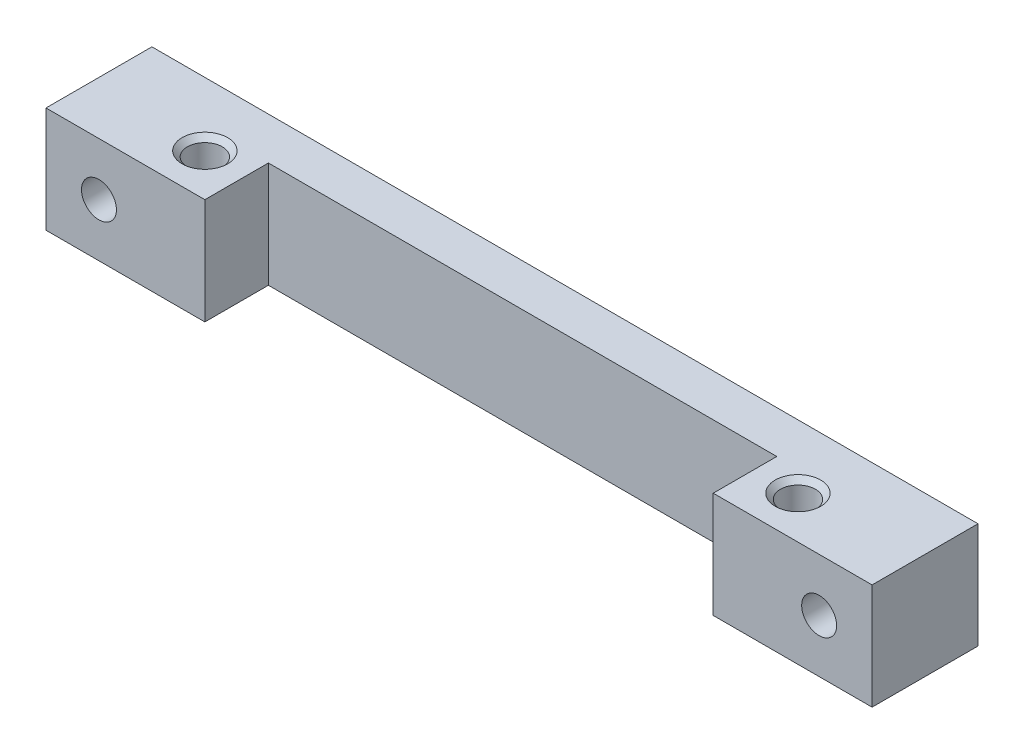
ISO-10303-21;
HEADER;
FILE_DESCRIPTION(('STEP AP214'),'2;1');
FILE_NAME('part.step','',(''),(''),'','','');
FILE_SCHEMA(('AUTOMOTIVE_DESIGN { 1 0 10303 214 1 1 1 1 }'));
ENDSEC;
DATA;
#1=APPLICATION_CONTEXT('core data for automotive mechanical design processes');
#2=APPLICATION_PROTOCOL_DEFINITION('international standard','automotive_design',2000,#1);
#3=PRODUCT_CONTEXT('',#1,'mechanical');
#4=PRODUCT('Part','Part','',(#3));
#5=PRODUCT_RELATED_PRODUCT_CATEGORY('part','',(#4));
#6=PRODUCT_DEFINITION_FORMATION('','',#4);
#7=PRODUCT_DEFINITION_CONTEXT('part definition',#1,'design');
#8=PRODUCT_DEFINITION('design','',#6,#7);
#9=PRODUCT_DEFINITION_SHAPE('','',#8);
#10=(LENGTH_UNIT() NAMED_UNIT(*) SI_UNIT(.MILLI.,.METRE.));
#11=(NAMED_UNIT(*) PLANE_ANGLE_UNIT() SI_UNIT($,.RADIAN.));
#12=(NAMED_UNIT(*) SI_UNIT($,.STERADIAN.) SOLID_ANGLE_UNIT());
#13=UNCERTAINTY_MEASURE_WITH_UNIT(LENGTH_MEASURE(1.E-05),#10,'distance_accuracy_value','');
#14=(GEOMETRIC_REPRESENTATION_CONTEXT(3) GLOBAL_UNCERTAINTY_ASSIGNED_CONTEXT((#13)) GLOBAL_UNIT_ASSIGNED_CONTEXT((#10,
#11,#12)) REPRESENTATION_CONTEXT('',''));
#15=CARTESIAN_POINT('',(0.,0.,0.));
#16=DIRECTION('',(0.,0.,1.));
#17=DIRECTION('',(1.,0.,0.));
#18=AXIS2_PLACEMENT_3D('',#15,#16,#17);
#19=CARTESIAN_POINT('',(-39.0000000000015,9.99999999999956,9.99999999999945));
#20=DIRECTION('',(0.,0.,-1.));
#21=DIRECTION('',(-1.00000000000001,0.,0.));
#22=AXIS2_PLACEMENT_3D('',#19,#20,#21);
#23=PLANE('',#22);
#24=CARTESIAN_POINT('',(-34.0000000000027,4.99999999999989,10.0000000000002));
#25=DIRECTION('',(0.,0.,-0.999999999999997));
#26=DIRECTION('',(-1.00000000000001,0.,0.));
#27=AXIS2_PLACEMENT_3D('',#24,#25,#26);
#28=CIRCLE('',#27,1.65);
#29=CARTESIAN_POINT('',(-35.6500000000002,5.00000000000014,10.0000000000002));
#30=VERTEX_POINT('',#29);
#31=EDGE_CURVE('E206',#30,#30,#28,.T.);
#32=ORIENTED_EDGE('',*,*,#31,.T.);
#33=EDGE_LOOP('',(#32));
#34=FACE_BOUND('',#33,.T.);
#35=DIRECTION('',(1.00000000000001,0.,0.));
#36=VECTOR('',#35,1.);
#37=CARTESIAN_POINT('',(-39.0000000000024,-6.10622663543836E-13,10.0000000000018));
#38=LINE('',#37,#36);
#39=CARTESIAN_POINT('',(-39.0000000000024,-6.10622663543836E-13,10.0000000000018));
#40=VERTEX_POINT('',#39);
#41=CARTESIAN_POINT('',(-24.0000000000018,1.27675647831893E-12,10.0000000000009));
#42=VERTEX_POINT('',#41);
#43=EDGE_CURVE('E136',#40,#42,#38,.T.);
#44=ORIENTED_EDGE('',*,*,#43,.T.);
#45=DIRECTION('',(0.,-0.999999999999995,0.));
#46=VECTOR('',#45,1.);
#47=CARTESIAN_POINT('',(-24.000000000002,10.0000000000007,10.0000000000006));
#48=LINE('',#47,#46);
#49=CARTESIAN_POINT('',(-24.000000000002,10.0000000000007,10.0000000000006));
#50=VERTEX_POINT('',#49);
#51=EDGE_CURVE('E164',#50,#42,#48,.T.);
#52=ORIENTED_EDGE('',*,*,#51,.F.);
#53=DIRECTION('',(1.00000000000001,0.,0.));
#54=VECTOR('',#53,1.);
#55=CARTESIAN_POINT('',(-39.0000000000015,9.99999999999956,9.99999999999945));
#56=LINE('',#55,#54);
#57=CARTESIAN_POINT('',(-39.0000000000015,9.99999999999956,9.99999999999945));
#58=VERTEX_POINT('',#57);
#59=EDGE_CURVE('E151',#58,#50,#56,.T.);
#60=ORIENTED_EDGE('',*,*,#59,.F.);
#61=DIRECTION('',(0.,-0.999999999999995,0.));
#62=VECTOR('',#61,1.);
#63=CARTESIAN_POINT('',(-39.0000000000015,9.99999999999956,9.99999999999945));
#64=LINE('',#63,#62);
#65=EDGE_CURVE('E132',#58,#40,#64,.T.);
#66=ORIENTED_EDGE('',*,*,#65,.T.);
#67=EDGE_LOOP('',(#44,#52,#60,#66));
#68=FACE_BOUND('',#67,.T.);
#69=ADVANCED_FACE('F38',(#34,#68),#23,.F.);
#70=CARTESIAN_POINT('',(-24.000000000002,10.0000000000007,10.0000000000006));
#71=DIRECTION('',(-1.00000000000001,0.,0.));
#72=DIRECTION('',(0.,0.,0.999999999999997));
#73=AXIS2_PLACEMENT_3D('',#70,#71,#72);
#74=PLANE('',#73);
#75=DIRECTION('',(0.,0.,-0.999999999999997));
#76=VECTOR('',#75,1.);
#77=CARTESIAN_POINT('',(-24.0000000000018,1.27675647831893E-12,10.0000000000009));
#78=LINE('',#77,#76);
#79=CARTESIAN_POINT('',(-24.0000000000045,7.21644966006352E-13,4.00000000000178));
#80=VERTEX_POINT('',#79);
#81=EDGE_CURVE('E139',#42,#80,#78,.T.);
#82=ORIENTED_EDGE('',*,*,#81,.T.);
#83=DIRECTION('',(0.,-0.999999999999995,0.));
#84=VECTOR('',#83,1.);
#85=CARTESIAN_POINT('',(-24.000000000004,10.0000000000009,4.00000000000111));
#86=LINE('',#85,#84);
#87=CARTESIAN_POINT('',(-24.000000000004,10.0000000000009,4.00000000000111));
#88=VERTEX_POINT('',#87);
#89=EDGE_CURVE('E161',#88,#80,#86,.T.);
#90=ORIENTED_EDGE('',*,*,#89,.F.);
#91=DIRECTION('',(0.,0.,-0.999999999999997));
#92=VECTOR('',#91,1.);
#93=CARTESIAN_POINT('',(-24.000000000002,10.0000000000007,10.0000000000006));
#94=LINE('',#93,#92);
#95=EDGE_CURVE('E99',#50,#88,#94,.T.);
#96=ORIENTED_EDGE('',*,*,#95,.F.);
#97=ORIENTED_EDGE('',*,*,#51,.T.);
#98=EDGE_LOOP('',(#82,#90,#96,#97));
#99=FACE_BOUND('',#98,.T.);
#100=ADVANCED_FACE('F243',(#99),#74,.F.);
#101=CARTESIAN_POINT('',(-24.000000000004,10.0000000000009,4.00000000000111));
#102=DIRECTION('',(0.,0.,-0.999999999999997));
#103=DIRECTION('',(-1.00000000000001,0.,0.));
#104=AXIS2_PLACEMENT_3D('',#101,#102,#103);
#105=PLANE('',#104);
#106=DIRECTION('',(1.00000000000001,0.,0.));
#107=VECTOR('',#106,1.);
#108=CARTESIAN_POINT('',(-24.0000000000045,7.21644966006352E-13,4.00000000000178));
#109=LINE('',#108,#107);
#110=CARTESIAN_POINT('',(23.9999999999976,2.22044604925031E-12,4.00000000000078));
#111=VERTEX_POINT('',#110);
#112=EDGE_CURVE('E142',#80,#111,#109,.T.);
#113=ORIENTED_EDGE('',*,*,#112,.T.);
#114=DIRECTION('',(0.,-0.999999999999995,0.));
#115=VECTOR('',#114,1.);
#116=CARTESIAN_POINT('',(23.9999999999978,10.000000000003,4.00000000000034));
#117=LINE('',#116,#115);
#118=CARTESIAN_POINT('',(23.9999999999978,10.000000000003,4.00000000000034));
#119=VERTEX_POINT('',#118);
#120=EDGE_CURVE('E158',#119,#111,#117,.T.);
#121=ORIENTED_EDGE('',*,*,#120,.F.);
#122=DIRECTION('',(1.00000000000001,0.,0.));
#123=VECTOR('',#122,1.);
#124=CARTESIAN_POINT('',(-24.000000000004,10.0000000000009,4.00000000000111));
#125=LINE('',#124,#123);
#126=EDGE_CURVE('E212',#88,#119,#125,.T.);
#127=ORIENTED_EDGE('',*,*,#126,.F.);
#128=ORIENTED_EDGE('',*,*,#89,.T.);
#129=EDGE_LOOP('',(#113,#121,#127,#128));
#130=FACE_BOUND('',#129,.T.);
#131=ADVANCED_FACE('F249',(#130),#105,.F.);
#132=CARTESIAN_POINT('',(23.9999999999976,10.,10.0000000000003));
#133=DIRECTION('',(1.00000000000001,0.,0.));
#134=DIRECTION('',(0.,0.,-0.999999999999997));
#135=AXIS2_PLACEMENT_3D('',#132,#133,#134);
#136=PLANE('',#135);
#137=DIRECTION('',(0.,0.,0.999999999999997));
#138=VECTOR('',#137,1.);
#139=CARTESIAN_POINT('',(23.9999999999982,0.,10.0000000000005));
#140=LINE('',#139,#138);
#141=CARTESIAN_POINT('',(23.9999999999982,0.,10.0000000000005));
#142=VERTEX_POINT('',#141);
#143=EDGE_CURVE('E144',#111,#142,#140,.T.);
#144=ORIENTED_EDGE('',*,*,#143,.T.);
#145=DIRECTION('',(0.,-0.999999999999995,0.));
#146=VECTOR('',#145,1.);
#147=CARTESIAN_POINT('',(23.9999999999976,10.,10.0000000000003));
#148=LINE('',#147,#146);
#149=CARTESIAN_POINT('',(23.9999999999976,10.,10.0000000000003));
#150=VERTEX_POINT('',#149);
#151=EDGE_CURVE('E155',#150,#142,#148,.T.);
#152=ORIENTED_EDGE('',*,*,#151,.F.);
#153=DIRECTION('',(0.,0.,0.999999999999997));
#154=VECTOR('',#153,1.);
#155=CARTESIAN_POINT('',(23.9999999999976,10.,10.0000000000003));
#156=LINE('',#155,#154);
#157=EDGE_CURVE('E214',#119,#150,#156,.T.);
#158=ORIENTED_EDGE('',*,*,#157,.F.);
#159=ORIENTED_EDGE('',*,*,#120,.T.);
#160=EDGE_LOOP('',(#144,#152,#158,#159));
#161=FACE_BOUND('',#160,.T.);
#162=ADVANCED_FACE('F220',(#161),#136,.F.);
#163=CARTESIAN_POINT('',(38.9999999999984,10.0000000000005,10.0000000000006));
#164=DIRECTION('',(0.,0.,-0.999999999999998));
#165=DIRECTION('',(-1.00000000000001,0.,0.));
#166=AXIS2_PLACEMENT_3D('',#163,#164,#165);
#167=PLANE('',#166);
#168=CARTESIAN_POINT('',(33.9999999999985,4.99999999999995,9.9999999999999));
#169=DIRECTION('',(0.,0.,-0.999999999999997));
#170=DIRECTION('',(-1.00000000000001,0.,0.));
#171=AXIS2_PLACEMENT_3D('',#168,#169,#170);
#172=CIRCLE('',#171,1.65);
#173=CARTESIAN_POINT('',(32.3499999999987,5.00000000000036,9.9999999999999));
#174=VERTEX_POINT('',#173);
#175=EDGE_CURVE('E273',#174,#174,#172,.T.);
#176=ORIENTED_EDGE('',*,*,#175,.T.);
#177=EDGE_LOOP('',(#176));
#178=FACE_BOUND('',#177,.T.);
#179=DIRECTION('',(1.00000000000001,0.,0.));
#180=VECTOR('',#179,1.);
#181=CARTESIAN_POINT('',(38.9999999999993,1.66533453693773E-13,10.0000000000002));
#182=LINE('',#181,#180);
#183=CARTESIAN_POINT('',(38.9999999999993,1.66533453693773E-13,10.0000000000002));
#184=VERTEX_POINT('',#183);
#185=EDGE_CURVE('E146',#142,#184,#182,.T.);
#186=ORIENTED_EDGE('',*,*,#185,.T.);
#187=DIRECTION('',(0.,-0.999999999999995,0.));
#188=VECTOR('',#187,1.);
#189=CARTESIAN_POINT('',(38.9999999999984,10.0000000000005,10.0000000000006));
#190=LINE('',#189,#188);
#191=CARTESIAN_POINT('',(38.9999999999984,10.0000000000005,10.0000000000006));
#192=VERTEX_POINT('',#191);
#193=EDGE_CURVE('E127',#192,#184,#190,.T.);
#194=ORIENTED_EDGE('',*,*,#193,.F.);
#195=DIRECTION('',(1.00000000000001,0.,0.));
#196=VECTOR('',#195,1.);
#197=CARTESIAN_POINT('',(38.9999999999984,10.0000000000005,10.0000000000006));
#198=LINE('',#197,#196);
#199=EDGE_CURVE('E118',#150,#192,#198,.T.);
#200=ORIENTED_EDGE('',*,*,#199,.F.);
#201=ORIENTED_EDGE('',*,*,#151,.T.);
#202=EDGE_LOOP('',(#186,#194,#200,#201));
#203=FACE_BOUND('',#202,.T.);
#204=ADVANCED_FACE('F224',(#178,#203),#167,.F.);
#205=CARTESIAN_POINT('',(38.9999999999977,9.99999999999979,5.55111512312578E-13));
#206=DIRECTION('',(-1.00000000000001,0.,0.));
#207=DIRECTION('',(0.,0.,0.999999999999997));
#208=AXIS2_PLACEMENT_3D('',#205,#206,#207);
#209=PLANE('',#208);
#210=DIRECTION('',(0.,0.,-0.999999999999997));
#211=VECTOR('',#210,1.);
#212=CARTESIAN_POINT('',(38.9999999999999,-6.66133814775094E-13,-2.22044604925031E-13));
#213=LINE('',#212,#211);
#214=CARTESIAN_POINT('',(38.9999999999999,-6.66133814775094E-13,-2.22044604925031E-13));
#215=VERTEX_POINT('',#214);
#216=EDGE_CURVE('E126',#184,#215,#213,.T.);
#217=ORIENTED_EDGE('',*,*,#216,.T.);
#218=DIRECTION('',(0.,-0.999999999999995,0.));
#219=VECTOR('',#218,1.);
#220=CARTESIAN_POINT('',(38.9999999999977,9.99999999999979,5.55111512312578E-13));
#221=LINE('',#220,#219);
#222=CARTESIAN_POINT('',(38.9999999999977,9.99999999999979,5.55111512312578E-13));
#223=VERTEX_POINT('',#222);
#224=EDGE_CURVE('E123',#223,#215,#221,.T.);
#225=ORIENTED_EDGE('',*,*,#224,.F.);
#226=DIRECTION('',(0.,0.,-0.999999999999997));
#227=VECTOR('',#226,1.);
#228=CARTESIAN_POINT('',(38.9999999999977,9.99999999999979,5.55111512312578E-13));
#229=LINE('',#228,#227);
#230=EDGE_CURVE('E112',#192,#223,#229,.T.);
#231=ORIENTED_EDGE('',*,*,#230,.F.);
#232=ORIENTED_EDGE('',*,*,#193,.T.);
#233=EDGE_LOOP('',(#217,#225,#231,#232));
#234=FACE_BOUND('',#233,.T.);
#235=ADVANCED_FACE('F124',(#234),#209,.F.);
#236=CARTESIAN_POINT('',(38.9999999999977,9.99999999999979,5.55111512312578E-13));
#237=DIRECTION('',(0.,0.,0.999999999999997));
#238=DIRECTION('',(1.00000000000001,0.,0.));
#239=AXIS2_PLACEMENT_3D('',#236,#237,#238);
#240=PLANE('',#239);
#241=CARTESIAN_POINT('',(-34.0000000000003,5.00000000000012,2.22044604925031E-13));
#242=DIRECTION('',(0.,0.,0.999999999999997));
#243=DIRECTION('',(1.00000000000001,0.,0.));
#244=AXIS2_PLACEMENT_3D('',#241,#242,#243);
#245=CIRCLE('',#244,2.14999999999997);
#246=CARTESIAN_POINT('',(-36.1500000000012,5.00000000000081,2.24321429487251E-13));
#247=VERTEX_POINT('',#246);
#248=EDGE_CURVE('E172',#247,#247,#245,.T.);
#249=ORIENTED_EDGE('',*,*,#248,.T.);
#250=EDGE_LOOP('',(#249));
#251=FACE_BOUND('',#250,.T.);
#252=CARTESIAN_POINT('',(33.9999999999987,5.00000000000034,0.));
#253=DIRECTION('',(0.,0.,0.999999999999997));
#254=DIRECTION('',(1.00000000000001,0.,0.));
#255=AXIS2_PLACEMENT_3D('',#252,#253,#254);
#256=CIRCLE('',#255,2.14999999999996);
#257=CARTESIAN_POINT('',(31.8500000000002,4.9999999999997,0.));
#258=VERTEX_POINT('',#257);
#259=EDGE_CURVE('E169',#258,#258,#256,.T.);
#260=ORIENTED_EDGE('',*,*,#259,.T.);
#261=EDGE_LOOP('',(#260));
#262=FACE_BOUND('',#261,.T.);
#263=DIRECTION('',(-1.00000000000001,0.,0.));
#264=VECTOR('',#263,1.);
#265=CARTESIAN_POINT('',(38.9999999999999,-6.66133814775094E-13,-2.22044604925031E-13));
#266=LINE('',#265,#264);
#267=CARTESIAN_POINT('',(-39.0000000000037,1.77635683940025E-12,1.4432899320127E-12));
#268=VERTEX_POINT('',#267);
#269=EDGE_CURVE('E84',#215,#268,#266,.T.);
#270=ORIENTED_EDGE('',*,*,#269,.T.);
#271=DIRECTION('',(0.,-0.999999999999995,0.));
#272=VECTOR('',#271,1.);
#273=CARTESIAN_POINT('',(-39.0000000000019,10.0000000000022,-2.22044604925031E-13));
#274=LINE('',#273,#272);
#275=CARTESIAN_POINT('',(-39.0000000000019,10.0000000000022,-2.22044604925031E-13));
#276=VERTEX_POINT('',#275);
#277=EDGE_CURVE('E128',#276,#268,#274,.T.);
#278=ORIENTED_EDGE('',*,*,#277,.F.);
#279=DIRECTION('',(-1.00000000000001,0.,0.));
#280=VECTOR('',#279,1.);
#281=CARTESIAN_POINT('',(38.9999999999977,9.99999999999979,5.55111512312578E-13));
#282=LINE('',#281,#280);
#283=EDGE_CURVE('E116',#223,#276,#282,.T.);
#284=ORIENTED_EDGE('',*,*,#283,.F.);
#285=ORIENTED_EDGE('',*,*,#224,.T.);
#286=EDGE_LOOP('',(#270,#278,#284,#285));
#287=FACE_BOUND('',#286,.T.);
#288=ADVANCED_FACE('F130',(#251,#262,#287),#240,.F.);
#289=CARTESIAN_POINT('',(-39.0000000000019,10.0000000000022,-2.22044604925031E-13));
#290=DIRECTION('',(1.00000000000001,0.,0.));
#291=DIRECTION('',(0.,0.,-0.999999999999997));
#292=AXIS2_PLACEMENT_3D('',#289,#290,#291);
#293=PLANE('',#292);
#294=DIRECTION('',(0.,0.,0.999999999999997));
#295=VECTOR('',#294,1.);
#296=CARTESIAN_POINT('',(-39.0000000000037,1.77635683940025E-12,1.4432899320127E-12));
#297=LINE('',#296,#295);
#298=EDGE_CURVE('E90',#268,#40,#297,.T.);
#299=ORIENTED_EDGE('',*,*,#298,.T.);
#300=ORIENTED_EDGE('',*,*,#65,.F.);
#301=DIRECTION('',(0.,0.,0.999999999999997));
#302=VECTOR('',#301,1.);
#303=CARTESIAN_POINT('',(-39.0000000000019,10.0000000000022,-2.22044604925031E-13));
#304=LINE('',#303,#302);
#305=EDGE_CURVE('E55',#276,#58,#304,.T.);
#306=ORIENTED_EDGE('',*,*,#305,.F.);
#307=ORIENTED_EDGE('',*,*,#277,.T.);
#308=EDGE_LOOP('',(#299,#300,#306,#307));
#309=FACE_BOUND('',#308,.T.);
#310=ADVANCED_FACE('F231',(#309),#293,.F.);
#311=CARTESIAN_POINT('',(-8.88178419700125E-13,10.0000000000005,-1.11022302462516E-13));
#312=DIRECTION('',(0.,0.999999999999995,0.));
#313=DIRECTION('',(0.,0.,0.999999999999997));
#314=AXIS2_PLACEMENT_3D('',#311,#312,#313);
#315=PLANE('',#314);
#316=CARTESIAN_POINT('',(27.9999999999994,10.0000000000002,5.99999999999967));
#317=DIRECTION('',(0.,0.999999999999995,0.));
#318=DIRECTION('',(0.,0.,0.999999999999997));
#319=AXIS2_PLACEMENT_3D('',#316,#317,#318);
#320=CIRCLE('',#319,2.15000000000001);
#321=CARTESIAN_POINT('',(27.9999999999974,10.0000000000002,8.15000000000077));
#322=VERTEX_POINT('',#321);
#323=EDGE_CURVE('E47',#322,#322,#320,.F.);
#324=ORIENTED_EDGE('',*,*,#323,.T.);
#325=EDGE_LOOP('',(#324));
#326=FACE_BOUND('',#325,.T.);
#327=CARTESIAN_POINT('',(-28.0000000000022,10.0000000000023,5.99999999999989));
#328=DIRECTION('',(0.,0.999999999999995,0.));
#329=DIRECTION('',(0.,0.,0.999999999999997));
#330=AXIS2_PLACEMENT_3D('',#327,#328,#329);
#331=CIRCLE('',#330,2.15000000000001);
#332=CARTESIAN_POINT('',(-28.0000000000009,10.0000000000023,8.15000000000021));
#333=VERTEX_POINT('',#332);
#334=EDGE_CURVE('E181',#333,#333,#331,.F.);
#335=ORIENTED_EDGE('',*,*,#334,.T.);
#336=EDGE_LOOP('',(#335));
#337=FACE_BOUND('',#336,.T.);
#338=ORIENTED_EDGE('',*,*,#59,.T.);
#339=ORIENTED_EDGE('',*,*,#95,.T.);
#340=ORIENTED_EDGE('',*,*,#126,.T.);
#341=ORIENTED_EDGE('',*,*,#157,.T.);
#342=ORIENTED_EDGE('',*,*,#199,.T.);
#343=ORIENTED_EDGE('',*,*,#230,.T.);
#344=ORIENTED_EDGE('',*,*,#283,.T.);
#345=ORIENTED_EDGE('',*,*,#305,.T.);
#346=EDGE_LOOP('',(#338,#339,#340,#341,#342,#343,#344,#345));
#347=FACE_BOUND('',#346,.T.);
#348=ADVANCED_FACE('F114',(#326,#337,#347),#315,.T.);
#349=CARTESIAN_POINT('',(0.,0.,0.));
#350=DIRECTION('',(0.,0.999999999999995,0.));
#351=DIRECTION('',(0.,0.,0.999999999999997));
#352=AXIS2_PLACEMENT_3D('',#349,#350,#351);
#353=PLANE('',#352);
#354=CARTESIAN_POINT('',(-28.0000000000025,1.11022302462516E-12,6.00000000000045));
#355=DIRECTION('',(0.,0.999999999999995,0.));
#356=DIRECTION('',(0.,0.,0.999999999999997));
#357=AXIS2_PLACEMENT_3D('',#354,#355,#356);
#358=CIRCLE('',#357,1.65);
#359=CARTESIAN_POINT('',(-28.0000000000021,1.10848830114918E-12,7.64999999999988));
#360=VERTEX_POINT('',#359);
#361=EDGE_CURVE('E203',#360,#360,#358,.T.);
#362=ORIENTED_EDGE('',*,*,#361,.T.);
#363=EDGE_LOOP('',(#362));
#364=FACE_BOUND('',#363,.T.);
#365=CARTESIAN_POINT('',(27.9999999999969,4.44089209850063E-13,6.00000000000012));
#366=DIRECTION('',(0.,0.999999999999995,0.));
#367=DIRECTION('',(0.,0.,0.999999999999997));
#368=AXIS2_PLACEMENT_3D('',#365,#366,#367);
#369=CIRCLE('',#368,1.65);
#370=CARTESIAN_POINT('',(27.9999999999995,4.42354486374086E-13,7.64999999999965));
#371=VERTEX_POINT('',#370);
#372=EDGE_CURVE('E140',#371,#371,#369,.T.);
#373=ORIENTED_EDGE('',*,*,#372,.T.);
#374=EDGE_LOOP('',(#373));
#375=FACE_BOUND('',#374,.T.);
#376=ORIENTED_EDGE('',*,*,#43,.F.);
#377=ORIENTED_EDGE('',*,*,#298,.F.);
#378=ORIENTED_EDGE('',*,*,#269,.F.);
#379=ORIENTED_EDGE('',*,*,#216,.F.);
#380=ORIENTED_EDGE('',*,*,#185,.F.);
#381=ORIENTED_EDGE('',*,*,#143,.F.);
#382=ORIENTED_EDGE('',*,*,#112,.F.);
#383=ORIENTED_EDGE('',*,*,#81,.F.);
#384=EDGE_LOOP('',(#376,#377,#378,#379,#380,#381,#382,#383));
#385=FACE_BOUND('',#384,.T.);
#386=ADVANCED_FACE('F198',(#364,#375,#385),#353,.F.);
#387=CARTESIAN_POINT('',(27.9999999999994,10.0000000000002,5.99999999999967));
#388=DIRECTION('',(0.,0.999999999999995,0.));
#389=DIRECTION('',(0.,0.,0.999999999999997));
#390=AXIS2_PLACEMENT_3D('',#387,#388,#389);
#391=CYLINDRICAL_SURFACE('',#390,1.64999999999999);
#392=CARTESIAN_POINT('',(27.9999999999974,9.50000000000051,6.00000000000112));
#393=DIRECTION('',(0.,0.999999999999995,0.));
#394=DIRECTION('',(0.,0.,0.999999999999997));
#395=AXIS2_PLACEMENT_3D('',#392,#393,#394);
#396=CIRCLE('',#395,1.64999999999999);
#397=CARTESIAN_POINT('',(27.9999999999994,9.50000000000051,7.64999999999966));
#398=VERTEX_POINT('',#397);
#399=EDGE_CURVE('E178',#398,#398,#396,.T.);
#400=CARTESIAN_POINT('',(27.9999999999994,9.50000000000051,7.64999999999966));
#401=CARTESIAN_POINT('',(27.9999999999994,9.40104166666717,7.64999999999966));
#402=CARTESIAN_POINT('',(27.9999999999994,9.30208333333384,7.64999999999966));
#403=CARTESIAN_POINT('',(27.9999999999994,9.10416666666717,7.64999999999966));
#404=CARTESIAN_POINT('',(27.9999999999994,9.00520833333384,7.64999999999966));
#405=CARTESIAN_POINT('',(27.9999999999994,8.80729166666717,7.64999999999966));
#406=CARTESIAN_POINT('',(27.9999999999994,8.70833333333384,7.64999999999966));
#407=CARTESIAN_POINT('',(27.9999999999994,8.51041666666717,7.64999999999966));
#408=CARTESIAN_POINT('',(27.9999999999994,8.41145833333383,7.64999999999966));
#409=CARTESIAN_POINT('',(27.9999999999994,8.21354166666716,7.64999999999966));
#410=CARTESIAN_POINT('',(27.9999999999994,8.11458333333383,7.64999999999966));
#411=CARTESIAN_POINT('',(27.9999999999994,7.91666666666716,7.64999999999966));
#412=CARTESIAN_POINT('',(27.9999999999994,7.81770833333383,7.64999999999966));
#413=CARTESIAN_POINT('',(27.9999999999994,7.61979166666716,7.64999999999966));
#414=CARTESIAN_POINT('',(27.9999999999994,7.52083333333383,7.64999999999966));
#415=CARTESIAN_POINT('',(27.9999999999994,7.32291666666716,7.64999999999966));
#416=CARTESIAN_POINT('',(27.9999999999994,7.22395833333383,7.64999999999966));
#417=CARTESIAN_POINT('',(27.9999999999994,7.02604166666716,7.64999999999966));
#418=CARTESIAN_POINT('',(27.9999999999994,6.92708333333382,7.64999999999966));
#419=CARTESIAN_POINT('',(27.9999999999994,6.72916666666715,7.64999999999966));
#420=CARTESIAN_POINT('',(27.9999999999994,6.63020833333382,7.64999999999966));
#421=CARTESIAN_POINT('',(27.9999999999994,6.43229166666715,7.64999999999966));
#422=CARTESIAN_POINT('',(27.9999999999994,6.33333333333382,7.64999999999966));
#423=CARTESIAN_POINT('',(27.9999999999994,6.13541666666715,7.64999999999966));
#424=CARTESIAN_POINT('',(27.9999999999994,6.03645833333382,7.64999999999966));
#425=CARTESIAN_POINT('',(27.9999999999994,5.83854166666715,7.64999999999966));
#426=CARTESIAN_POINT('',(27.9999999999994,5.73958333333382,7.64999999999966));
#427=CARTESIAN_POINT('',(27.9999999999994,5.54166666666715,7.64999999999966));
#428=CARTESIAN_POINT('',(27.9999999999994,5.44270833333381,7.64999999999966));
#429=CARTESIAN_POINT('',(27.9999999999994,5.24479166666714,7.64999999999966));
#430=CARTESIAN_POINT('',(27.9999999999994,5.14583333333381,7.64999999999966));
#431=CARTESIAN_POINT('',(27.9999999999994,4.94791666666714,7.64999999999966));
#432=CARTESIAN_POINT('',(27.9999999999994,4.84895833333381,7.64999999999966));
#433=CARTESIAN_POINT('',(27.9999999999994,4.65104166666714,7.64999999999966));
#434=CARTESIAN_POINT('',(27.9999999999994,4.55208333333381,7.64999999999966));
#435=CARTESIAN_POINT('',(27.9999999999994,4.35416666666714,7.64999999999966));
#436=CARTESIAN_POINT('',(27.9999999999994,4.2552083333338,7.64999999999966));
#437=CARTESIAN_POINT('',(27.9999999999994,4.05729166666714,7.64999999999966));
#438=CARTESIAN_POINT('',(27.9999999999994,3.9583333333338,7.64999999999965));
#439=CARTESIAN_POINT('',(27.9999999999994,3.76041666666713,7.64999999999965));
#440=CARTESIAN_POINT('',(27.9999999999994,3.6614583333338,7.64999999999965));
#441=CARTESIAN_POINT('',(27.9999999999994,3.46354166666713,7.64999999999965));
#442=CARTESIAN_POINT('',(27.9999999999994,3.3645833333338,7.64999999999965));
#443=CARTESIAN_POINT('',(27.9999999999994,3.16666666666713,7.64999999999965));
#444=CARTESIAN_POINT('',(27.9999999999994,3.0677083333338,7.64999999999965));
#445=CARTESIAN_POINT('',(27.9999999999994,2.86979166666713,7.64999999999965));
#446=CARTESIAN_POINT('',(27.9999999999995,2.77083333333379,7.64999999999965));
#447=CARTESIAN_POINT('',(27.9999999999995,2.57291666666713,7.64999999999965));
#448=CARTESIAN_POINT('',(27.9999999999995,2.47395833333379,7.64999999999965));
#449=CARTESIAN_POINT('',(27.9999999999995,2.27604166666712,7.64999999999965));
#450=CARTESIAN_POINT('',(27.9999999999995,2.17708333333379,7.64999999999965));
#451=CARTESIAN_POINT('',(27.9999999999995,1.97916666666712,7.64999999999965));
#452=CARTESIAN_POINT('',(27.9999999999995,1.88020833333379,7.64999999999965));
#453=CARTESIAN_POINT('',(27.9999999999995,1.68229166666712,7.64999999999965));
#454=CARTESIAN_POINT('',(27.9999999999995,1.58333333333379,7.64999999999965));
#455=CARTESIAN_POINT('',(27.9999999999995,1.38541666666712,7.64999999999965));
#456=CARTESIAN_POINT('',(27.9999999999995,1.28645833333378,7.64999999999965));
#457=CARTESIAN_POINT('',(27.9999999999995,1.08854166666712,7.64999999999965));
#458=CARTESIAN_POINT('',(27.9999999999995,0.989583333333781,7.64999999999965));
#459=CARTESIAN_POINT('',(27.9999999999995,0.791666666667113,7.64999999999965));
#460=CARTESIAN_POINT('',(27.9999999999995,0.69270833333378,7.64999999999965));
#461=CARTESIAN_POINT('',(27.9999999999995,0.494791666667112,7.64999999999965));
#462=CARTESIAN_POINT('',(27.9999999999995,0.395833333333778,7.64999999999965));
#463=CARTESIAN_POINT('',(27.9999999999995,0.19791666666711,7.64999999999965));
#464=CARTESIAN_POINT('',(27.9999999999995,0.0989583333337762,7.64999999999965));
#465=CARTESIAN_POINT('',(27.9999999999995,4.42354486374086E-13,7.64999999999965));
#466=B_SPLINE_CURVE_WITH_KNOTS('',3,(#400,#401,#402,#403,#404,#405,#406,#407,#408,#409,#410,
#411,#412,#413,#414,#415,#416,#417,#418,#419,#420,#421,#422,#423,#424,#425,#426,#427,#428,#429,
#430,#431,#432,#433,#434,#435,#436,#437,#438,#439,#440,#441,#442,#443,#444,#445,#446,#447,#448,
#449,#450,#451,#452,#453,#454,#455,#456,#457,#458,#459,#460,#461,#462,#463,#464,#465),
.UNSPECIFIED.,.F.,.F.,(4,2,2,2,2,2,2,2,2,2,2,2,2,2,2,2,2,2,2,2,2,2,2,2,2,2,2,2,2,2,2,2,4),(0.,
0.296875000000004,0.593750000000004,0.890625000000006,1.18750000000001,1.48437500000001,
1.78125000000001,2.07812500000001,2.37500000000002,2.67187500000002,2.96875000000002,
3.26562500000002,3.56250000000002,3.85937500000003,4.15625000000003,4.45312500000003,
4.75000000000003,5.04687500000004,5.34375000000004,5.64062500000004,5.93750000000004,
6.23437500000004,6.53125000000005,6.82812500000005,7.12500000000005,7.42187500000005,
7.71875000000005,8.01562500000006,8.31250000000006,8.60937500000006,8.90625000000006,
9.20312500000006,9.50000000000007),.UNSPECIFIED.);
#467=EDGE_CURVE('BSEAM194',#398,#371,#466,.T.);
#468=ORIENTED_EDGE('',*,*,#399,.T.);
#469=ORIENTED_EDGE('',*,*,#372,.F.);
#470=ORIENTED_EDGE('',*,*,#467,.T.);
#471=ORIENTED_EDGE('',*,*,#467,.F.);
#472=EDGE_LOOP('',(#468,#470,#469,#471));
#473=FACE_BOUND('',#472,.T.);
#474=ADVANCED_FACE('F194',(#473),#391,.F.);
#475=CARTESIAN_POINT('',(-28.0000000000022,10.0000000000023,5.99999999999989));
#476=DIRECTION('',(0.,0.999999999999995,0.));
#477=DIRECTION('',(0.,0.,0.999999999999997));
#478=AXIS2_PLACEMENT_3D('',#475,#476,#477);
#479=CYLINDRICAL_SURFACE('',#478,1.64999999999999);
#480=CARTESIAN_POINT('',(-28.0000000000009,9.50000000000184,5.99999999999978));
#481=DIRECTION('',(0.,0.999999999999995,0.));
#482=DIRECTION('',(0.,0.,0.999999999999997));
#483=AXIS2_PLACEMENT_3D('',#480,#481,#482);
#484=CIRCLE('',#483,1.64999999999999);
#485=CARTESIAN_POINT('',(-28.0000000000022,9.50000000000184,7.64999999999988));
#486=VERTEX_POINT('',#485);
#487=EDGE_CURVE('E11',#486,#486,#484,.T.);
#488=CARTESIAN_POINT('',(-28.0000000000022,9.50000000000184,7.64999999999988));
#489=CARTESIAN_POINT('',(-28.0000000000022,9.4010416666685,7.64999999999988));
#490=CARTESIAN_POINT('',(-28.0000000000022,9.30208333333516,7.64999999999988));
#491=CARTESIAN_POINT('',(-28.0000000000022,9.10416666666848,7.64999999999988));
#492=CARTESIAN_POINT('',(-28.0000000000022,9.00520833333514,7.64999999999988));
#493=CARTESIAN_POINT('',(-28.0000000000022,8.80729166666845,7.64999999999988));
#494=CARTESIAN_POINT('',(-28.0000000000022,8.70833333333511,7.64999999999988));
#495=CARTESIAN_POINT('',(-28.0000000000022,8.51041666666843,7.64999999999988));
#496=CARTESIAN_POINT('',(-28.0000000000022,8.41145833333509,7.64999999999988));
#497=CARTESIAN_POINT('',(-28.0000000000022,8.21354166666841,7.64999999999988));
#498=CARTESIAN_POINT('',(-28.0000000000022,8.11458333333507,7.64999999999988));
#499=CARTESIAN_POINT('',(-28.0000000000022,7.91666666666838,7.64999999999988));
#500=CARTESIAN_POINT('',(-28.0000000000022,7.81770833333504,7.64999999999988));
#501=CARTESIAN_POINT('',(-28.0000000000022,7.61979166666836,7.64999999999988));
#502=CARTESIAN_POINT('',(-28.0000000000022,7.52083333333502,7.64999999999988));
#503=CARTESIAN_POINT('',(-28.0000000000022,7.32291666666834,7.64999999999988));
#504=CARTESIAN_POINT('',(-28.0000000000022,7.223958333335,7.64999999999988));
#505=CARTESIAN_POINT('',(-28.0000000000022,7.02604166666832,7.64999999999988));
#506=CARTESIAN_POINT('',(-28.0000000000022,6.92708333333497,7.64999999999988));
#507=CARTESIAN_POINT('',(-28.0000000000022,6.72916666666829,7.64999999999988));
#508=CARTESIAN_POINT('',(-28.0000000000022,6.63020833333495,7.64999999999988));
#509=CARTESIAN_POINT('',(-28.0000000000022,6.43229166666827,7.64999999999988));
#510=CARTESIAN_POINT('',(-28.0000000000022,6.33333333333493,7.64999999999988));
#511=CARTESIAN_POINT('',(-28.0000000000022,6.13541666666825,7.64999999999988));
#512=CARTESIAN_POINT('',(-28.0000000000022,6.03645833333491,7.64999999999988));
#513=CARTESIAN_POINT('',(-28.0000000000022,5.83854166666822,7.64999999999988));
#514=CARTESIAN_POINT('',(-28.0000000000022,5.73958333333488,7.64999999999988));
#515=CARTESIAN_POINT('',(-28.0000000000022,5.5416666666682,7.64999999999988));
#516=CARTESIAN_POINT('',(-28.0000000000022,5.44270833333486,7.64999999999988));
#517=CARTESIAN_POINT('',(-28.0000000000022,5.24479166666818,7.64999999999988));
#518=CARTESIAN_POINT('',(-28.0000000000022,5.14583333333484,7.64999999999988));
#519=CARTESIAN_POINT('',(-28.0000000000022,4.94791666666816,7.64999999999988));
#520=CARTESIAN_POINT('',(-28.0000000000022,4.84895833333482,7.64999999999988));
#521=CARTESIAN_POINT('',(-28.0000000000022,4.65104166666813,7.64999999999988));
#522=CARTESIAN_POINT('',(-28.0000000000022,4.55208333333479,7.64999999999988));
#523=CARTESIAN_POINT('',(-28.0000000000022,4.35416666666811,7.64999999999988));
#524=CARTESIAN_POINT('',(-28.0000000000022,4.25520833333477,7.64999999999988));
#525=CARTESIAN_POINT('',(-28.0000000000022,4.05729166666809,7.64999999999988));
#526=CARTESIAN_POINT('',(-28.0000000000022,3.95833333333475,7.64999999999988));
#527=CARTESIAN_POINT('',(-28.0000000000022,3.76041666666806,7.64999999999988));
#528=CARTESIAN_POINT('',(-28.0000000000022,3.66145833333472,7.64999999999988));
#529=CARTESIAN_POINT('',(-28.0000000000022,3.46354166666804,7.64999999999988));
#530=CARTESIAN_POINT('',(-28.0000000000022,3.3645833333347,7.64999999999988));
#531=CARTESIAN_POINT('',(-28.0000000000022,3.16666666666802,7.64999999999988));
#532=CARTESIAN_POINT('',(-28.0000000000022,3.06770833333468,7.64999999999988));
#533=CARTESIAN_POINT('',(-28.0000000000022,2.869791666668,7.64999999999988));
#534=CARTESIAN_POINT('',(-28.0000000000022,2.77083333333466,7.64999999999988));
#535=CARTESIAN_POINT('',(-28.0000000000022,2.57291666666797,7.64999999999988));
#536=CARTESIAN_POINT('',(-28.0000000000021,2.47395833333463,7.64999999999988));
#537=CARTESIAN_POINT('',(-28.0000000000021,2.27604166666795,7.64999999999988));
#538=CARTESIAN_POINT('',(-28.0000000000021,2.17708333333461,7.64999999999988));
#539=CARTESIAN_POINT('',(-28.0000000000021,1.97916666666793,7.64999999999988));
#540=CARTESIAN_POINT('',(-28.0000000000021,1.88020833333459,7.64999999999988));
#541=CARTESIAN_POINT('',(-28.0000000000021,1.6822916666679,7.64999999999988));
#542=CARTESIAN_POINT('',(-28.0000000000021,1.58333333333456,7.64999999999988));
#543=CARTESIAN_POINT('',(-28.0000000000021,1.38541666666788,7.64999999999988));
#544=CARTESIAN_POINT('',(-28.0000000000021,1.28645833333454,7.64999999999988));
#545=CARTESIAN_POINT('',(-28.0000000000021,1.08854166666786,7.64999999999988));
#546=CARTESIAN_POINT('',(-28.0000000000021,0.989583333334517,7.64999999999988));
#547=CARTESIAN_POINT('',(-28.0000000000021,0.791666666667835,7.64999999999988));
#548=CARTESIAN_POINT('',(-28.0000000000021,0.692708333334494,7.64999999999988));
#549=CARTESIAN_POINT('',(-28.0000000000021,0.494791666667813,7.64999999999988));
#550=CARTESIAN_POINT('',(-28.0000000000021,0.395833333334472,7.64999999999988));
#551=CARTESIAN_POINT('',(-28.0000000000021,0.19791666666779,7.64999999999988));
#552=CARTESIAN_POINT('',(-28.0000000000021,0.0989583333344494,7.64999999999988));
#553=CARTESIAN_POINT('',(-28.0000000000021,1.10848830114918E-12,7.64999999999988));
#554=B_SPLINE_CURVE_WITH_KNOTS('',3,(#488,#489,#490,#491,#492,#493,#494,#495,#496,#497,#498,
#499,#500,#501,#502,#503,#504,#505,#506,#507,#508,#509,#510,#511,#512,#513,#514,#515,#516,#517,
#518,#519,#520,#521,#522,#523,#524,#525,#526,#527,#528,#529,#530,#531,#532,#533,#534,#535,#536,
#537,#538,#539,#540,#541,#542,#543,#544,#545,#546,#547,#548,#549,#550,#551,#552,#553),
.UNSPECIFIED.,.F.,.F.,(4,2,2,2,2,2,2,2,2,2,2,2,2,2,2,2,2,2,2,2,2,2,2,2,2,2,2,2,2,2,2,2,4),(0.,
0.296875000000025,0.593750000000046,0.890625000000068,1.18750000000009,1.48437500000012,
1.78125000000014,2.07812500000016,2.37500000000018,2.67187500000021,2.96875000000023,
3.26562500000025,3.56250000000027,3.8593750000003,4.15625000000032,4.45312500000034,
4.75000000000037,5.04687500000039,5.34375000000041,5.64062500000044,5.93750000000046,
6.23437500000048,6.5312500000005,6.82812500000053,7.12500000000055,7.42187500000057,
7.7187500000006,8.01562500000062,8.31250000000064,8.60937500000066,8.90625000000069,
9.20312500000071,9.50000000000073),.UNSPECIFIED.);
#555=EDGE_CURVE('BSEAM197',#486,#360,#554,.T.);
#556=ORIENTED_EDGE('',*,*,#487,.T.);
#557=ORIENTED_EDGE('',*,*,#361,.F.);
#558=ORIENTED_EDGE('',*,*,#555,.T.);
#559=ORIENTED_EDGE('',*,*,#555,.F.);
#560=EDGE_LOOP('',(#556,#558,#557,#559));
#561=FACE_BOUND('',#560,.T.);
#562=ADVANCED_FACE('F197',(#561),#479,.F.);
#563=CARTESIAN_POINT('',(-34.0000000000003,5.00000000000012,2.22044604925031E-13));
#564=DIRECTION('',(0.,0.,-0.999999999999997));
#565=DIRECTION('',(-1.00000000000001,0.,0.));
#566=AXIS2_PLACEMENT_3D('',#563,#564,#565);
#567=CYLINDRICAL_SURFACE('',#566,1.64999999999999);
#568=CARTESIAN_POINT('',(-34.000000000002,5.00000000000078,0.49999999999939));
#569=DIRECTION('',(0.,0.,0.999999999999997));
#570=DIRECTION('',(1.00000000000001,0.,0.));
#571=AXIS2_PLACEMENT_3D('',#568,#569,#570);
#572=CIRCLE('',#571,1.64999999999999);
#573=CARTESIAN_POINT('',(-35.6500000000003,5.00000000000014,0.499999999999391));
#574=VERTEX_POINT('',#573);
#575=EDGE_CURVE('E166',#574,#574,#572,.F.);
#576=CARTESIAN_POINT('',(-35.6500000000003,5.00000000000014,0.499999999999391));
#577=CARTESIAN_POINT('',(-35.6500000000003,5.00000000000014,0.598958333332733));
#578=CARTESIAN_POINT('',(-35.6500000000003,5.00000000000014,0.697916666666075));
#579=CARTESIAN_POINT('',(-35.6500000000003,5.00000000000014,0.895833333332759));
#580=CARTESIAN_POINT('',(-35.6500000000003,5.00000000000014,0.994791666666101));
#581=CARTESIAN_POINT('',(-35.6500000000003,5.00000000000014,1.19270833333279));
#582=CARTESIAN_POINT('',(-35.6500000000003,5.00000000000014,1.29166666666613));
#583=CARTESIAN_POINT('',(-35.6500000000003,5.00000000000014,1.48958333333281));
#584=CARTESIAN_POINT('',(-35.6500000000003,5.00000000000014,1.58854166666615));
#585=CARTESIAN_POINT('',(-35.6500000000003,5.00000000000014,1.78645833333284));
#586=CARTESIAN_POINT('',(-35.6500000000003,5.00000000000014,1.88541666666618));
#587=CARTESIAN_POINT('',(-35.6500000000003,5.00000000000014,2.08333333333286));
#588=CARTESIAN_POINT('',(-35.6500000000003,5.00000000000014,2.18229166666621));
#589=CARTESIAN_POINT('',(-35.6500000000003,5.00000000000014,2.38020833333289));
#590=CARTESIAN_POINT('',(-35.6500000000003,5.00000000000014,2.47916666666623));
#591=CARTESIAN_POINT('',(-35.6500000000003,5.00000000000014,2.67708333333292));
#592=CARTESIAN_POINT('',(-35.6500000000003,5.00000000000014,2.77604166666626));
#593=CARTESIAN_POINT('',(-35.6500000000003,5.00000000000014,2.97395833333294));
#594=CARTESIAN_POINT('',(-35.6500000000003,5.00000000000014,3.07291666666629));
#595=CARTESIAN_POINT('',(-35.6500000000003,5.00000000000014,3.27083333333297));
#596=CARTESIAN_POINT('',(-35.6500000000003,5.00000000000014,3.36979166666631));
#597=CARTESIAN_POINT('',(-35.6500000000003,5.00000000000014,3.567708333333));
#598=CARTESIAN_POINT('',(-35.6500000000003,5.00000000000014,3.66666666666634));
#599=CARTESIAN_POINT('',(-35.6500000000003,5.00000000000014,3.86458333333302));
#600=CARTESIAN_POINT('',(-35.6500000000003,5.00000000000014,3.96354166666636));
#601=CARTESIAN_POINT('',(-35.6500000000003,5.00000000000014,4.16145833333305));
#602=CARTESIAN_POINT('',(-35.6500000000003,5.00000000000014,4.26041666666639));
#603=CARTESIAN_POINT('',(-35.6500000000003,5.00000000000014,4.45833333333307));
#604=CARTESIAN_POINT('',(-35.6500000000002,5.00000000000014,4.55729166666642));
#605=CARTESIAN_POINT('',(-35.6500000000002,5.00000000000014,4.7552083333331));
#606=CARTESIAN_POINT('',(-35.6500000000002,5.00000000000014,4.85416666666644));
#607=CARTESIAN_POINT('',(-35.6500000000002,5.00000000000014,5.05208333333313));
#608=CARTESIAN_POINT('',(-35.6500000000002,5.00000000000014,5.15104166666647));
#609=CARTESIAN_POINT('',(-35.6500000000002,5.00000000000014,5.34895833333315));
#610=CARTESIAN_POINT('',(-35.6500000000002,5.00000000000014,5.4479166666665));
#611=CARTESIAN_POINT('',(-35.6500000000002,5.00000000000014,5.64583333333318));
#612=CARTESIAN_POINT('',(-35.6500000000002,5.00000000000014,5.74479166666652));
#613=CARTESIAN_POINT('',(-35.6500000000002,5.00000000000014,5.94270833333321));
#614=CARTESIAN_POINT('',(-35.6500000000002,5.00000000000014,6.04166666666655));
#615=CARTESIAN_POINT('',(-35.6500000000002,5.00000000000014,6.23958333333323));
#616=CARTESIAN_POINT('',(-35.6500000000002,5.00000000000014,6.33854166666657));
#617=CARTESIAN_POINT('',(-35.6500000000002,5.00000000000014,6.53645833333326));
#618=CARTESIAN_POINT('',(-35.6500000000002,5.00000000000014,6.6354166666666));
#619=CARTESIAN_POINT('',(-35.6500000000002,5.00000000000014,6.83333333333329));
#620=CARTESIAN_POINT('',(-35.6500000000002,5.00000000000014,6.93229166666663));
#621=CARTESIAN_POINT('',(-35.6500000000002,5.00000000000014,7.13020833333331));
#622=CARTESIAN_POINT('',(-35.6500000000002,5.00000000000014,7.22916666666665));
#623=CARTESIAN_POINT('',(-35.6500000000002,5.00000000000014,7.42708333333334));
#624=CARTESIAN_POINT('',(-35.6500000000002,5.00000000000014,7.52604166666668));
#625=CARTESIAN_POINT('',(-35.6500000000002,5.00000000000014,7.72395833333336));
#626=CARTESIAN_POINT('',(-35.6500000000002,5.00000000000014,7.82291666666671));
#627=CARTESIAN_POINT('',(-35.6500000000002,5.00000000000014,8.02083333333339));
#628=CARTESIAN_POINT('',(-35.6500000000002,5.00000000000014,8.11979166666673));
#629=CARTESIAN_POINT('',(-35.6500000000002,5.00000000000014,8.31770833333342));
#630=CARTESIAN_POINT('',(-35.6500000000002,5.00000000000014,8.41666666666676));
#631=CARTESIAN_POINT('',(-35.6500000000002,5.00000000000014,8.61458333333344));
#632=CARTESIAN_POINT('',(-35.6500000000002,5.00000000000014,8.71354166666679));
#633=CARTESIAN_POINT('',(-35.6500000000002,5.00000000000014,8.91145833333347));
#634=CARTESIAN_POINT('',(-35.6500000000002,5.00000000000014,9.01041666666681));
#635=CARTESIAN_POINT('',(-35.6500000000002,5.00000000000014,9.2083333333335));
#636=CARTESIAN_POINT('',(-35.6500000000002,5.00000000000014,9.30729166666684));
#637=CARTESIAN_POINT('',(-35.6500000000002,5.00000000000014,9.50520833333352));
#638=CARTESIAN_POINT('',(-35.6500000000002,5.00000000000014,9.60416666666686));
#639=CARTESIAN_POINT('',(-35.6500000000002,5.00000000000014,9.80208333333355));
#640=CARTESIAN_POINT('',(-35.6500000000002,5.00000000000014,9.90104166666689));
#641=CARTESIAN_POINT('',(-35.6500000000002,5.00000000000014,10.0000000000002));
#642=B_SPLINE_CURVE_WITH_KNOTS('',3,(#576,#577,#578,#579,#580,#581,#582,#583,#584,#585,#586,
#587,#588,#589,#590,#591,#592,#593,#594,#595,#596,#597,#598,#599,#600,#601,#602,#603,#604,#605,
#606,#607,#608,#609,#610,#611,#612,#613,#614,#615,#616,#617,#618,#619,#620,#621,#622,#623,#624,
#625,#626,#627,#628,#629,#630,#631,#632,#633,#634,#635,#636,#637,#638,#639,#640,#641),
.UNSPECIFIED.,.F.,.F.,(4,2,2,2,2,2,2,2,2,2,2,2,2,2,2,2,2,2,2,2,2,2,2,2,2,2,2,2,2,2,2,2,4),(0.,
0.296875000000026,0.593750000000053,0.890625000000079,1.18750000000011,1.48437500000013,
1.78125000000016,2.07812500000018,2.37500000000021,2.67187500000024,2.96875000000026,
3.26562500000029,3.56250000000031,3.85937500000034,4.15625000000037,4.45312500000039,
4.75000000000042,5.04687500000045,5.34375000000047,5.6406250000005,5.93750000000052,
6.23437500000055,6.53125000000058,6.8281250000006,7.12500000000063,7.42187500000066,
7.71875000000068,8.01562500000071,8.31250000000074,8.60937500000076,8.90625000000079,
9.20312500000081,9.50000000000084),.UNSPECIFIED.);
#643=EDGE_CURVE('BSEAM269',#574,#30,#642,.T.);
#644=ORIENTED_EDGE('',*,*,#575,.T.);
#645=ORIENTED_EDGE('',*,*,#31,.F.);
#646=ORIENTED_EDGE('',*,*,#643,.T.);
#647=ORIENTED_EDGE('',*,*,#643,.F.);
#648=EDGE_LOOP('',(#644,#646,#645,#647));
#649=FACE_BOUND('',#648,.T.);
#650=ADVANCED_FACE('F269',(#649),#567,.F.);
#651=CARTESIAN_POINT('',(33.9999999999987,5.00000000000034,0.));
#652=DIRECTION('',(0.,0.,-0.999999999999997));
#653=DIRECTION('',(-1.00000000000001,0.,0.));
#654=AXIS2_PLACEMENT_3D('',#651,#652,#653);
#655=CYLINDRICAL_SURFACE('',#654,1.64999999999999);
#656=CARTESIAN_POINT('',(33.9999999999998,4.99999999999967,0.499999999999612));
#657=DIRECTION('',(0.,0.,0.999999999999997));
#658=DIRECTION('',(1.00000000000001,0.,0.));
#659=AXIS2_PLACEMENT_3D('',#656,#657,#658);
#660=CIRCLE('',#659,1.64999999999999);
#661=CARTESIAN_POINT('',(32.3499999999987,5.00000000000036,0.499999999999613));
#662=VERTEX_POINT('',#661);
#663=EDGE_CURVE('E175',#662,#662,#660,.F.);
#664=CARTESIAN_POINT('',(32.3499999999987,5.00000000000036,0.499999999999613));
#665=CARTESIAN_POINT('',(32.3499999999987,5.00000000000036,0.598958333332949));
#666=CARTESIAN_POINT('',(32.3499999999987,5.00000000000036,0.697916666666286));
#667=CARTESIAN_POINT('',(32.3499999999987,5.00000000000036,0.895833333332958));
#668=CARTESIAN_POINT('',(32.3499999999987,5.00000000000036,0.994791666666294));
#669=CARTESIAN_POINT('',(32.3499999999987,5.00000000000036,1.19270833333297));
#670=CARTESIAN_POINT('',(32.3499999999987,5.00000000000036,1.2916666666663));
#671=CARTESIAN_POINT('',(32.3499999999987,5.00000000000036,1.48958333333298));
#672=CARTESIAN_POINT('',(32.3499999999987,5.00000000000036,1.58854166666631));
#673=CARTESIAN_POINT('',(32.3499999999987,5.00000000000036,1.78645833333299));
#674=CARTESIAN_POINT('',(32.3499999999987,5.00000000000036,1.88541666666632));
#675=CARTESIAN_POINT('',(32.3499999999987,5.00000000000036,2.08333333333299));
#676=CARTESIAN_POINT('',(32.3499999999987,5.00000000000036,2.18229166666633));
#677=CARTESIAN_POINT('',(32.3499999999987,5.00000000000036,2.380208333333));
#678=CARTESIAN_POINT('',(32.3499999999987,5.00000000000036,2.47916666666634));
#679=CARTESIAN_POINT('',(32.3499999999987,5.00000000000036,2.67708333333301));
#680=CARTESIAN_POINT('',(32.3499999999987,5.00000000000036,2.77604166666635));
#681=CARTESIAN_POINT('',(32.3499999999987,5.00000000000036,2.97395833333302));
#682=CARTESIAN_POINT('',(32.3499999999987,5.00000000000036,3.07291666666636));
#683=CARTESIAN_POINT('',(32.3499999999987,5.00000000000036,3.27083333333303));
#684=CARTESIAN_POINT('',(32.3499999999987,5.00000000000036,3.36979166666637));
#685=CARTESIAN_POINT('',(32.3499999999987,5.00000000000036,3.56770833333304));
#686=CARTESIAN_POINT('',(32.3499999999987,5.00000000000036,3.66666666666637));
#687=CARTESIAN_POINT('',(32.3499999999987,5.00000000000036,3.86458333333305));
#688=CARTESIAN_POINT('',(32.3499999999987,5.00000000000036,3.96354166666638));
#689=CARTESIAN_POINT('',(32.3499999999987,5.00000000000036,4.16145833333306));
#690=CARTESIAN_POINT('',(32.3499999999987,5.00000000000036,4.26041666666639));
#691=CARTESIAN_POINT('',(32.3499999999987,5.00000000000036,4.45833333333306));
#692=CARTESIAN_POINT('',(32.3499999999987,5.00000000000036,4.5572916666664));
#693=CARTESIAN_POINT('',(32.3499999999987,5.00000000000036,4.75520833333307));
#694=CARTESIAN_POINT('',(32.3499999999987,5.00000000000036,4.85416666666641));
#695=CARTESIAN_POINT('',(32.3499999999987,5.00000000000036,5.05208333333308));
#696=CARTESIAN_POINT('',(32.3499999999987,5.00000000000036,5.15104166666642));
#697=CARTESIAN_POINT('',(32.3499999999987,5.00000000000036,5.34895833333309));
#698=CARTESIAN_POINT('',(32.3499999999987,5.00000000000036,5.44791666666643));
#699=CARTESIAN_POINT('',(32.3499999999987,5.00000000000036,5.6458333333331));
#700=CARTESIAN_POINT('',(32.3499999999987,5.00000000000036,5.74479166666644));
#701=CARTESIAN_POINT('',(32.3499999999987,5.00000000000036,5.94270833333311));
#702=CARTESIAN_POINT('',(32.3499999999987,5.00000000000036,6.04166666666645));
#703=CARTESIAN_POINT('',(32.3499999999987,5.00000000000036,6.23958333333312));
#704=CARTESIAN_POINT('',(32.3499999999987,5.00000000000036,6.33854166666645));
#705=CARTESIAN_POINT('',(32.3499999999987,5.00000000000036,6.53645833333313));
#706=CARTESIAN_POINT('',(32.3499999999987,5.00000000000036,6.63541666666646));
#707=CARTESIAN_POINT('',(32.3499999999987,5.00000000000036,6.83333333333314));
#708=CARTESIAN_POINT('',(32.3499999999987,5.00000000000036,6.93229166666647));
#709=CARTESIAN_POINT('',(32.3499999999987,5.00000000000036,7.13020833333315));
#710=CARTESIAN_POINT('',(32.3499999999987,5.00000000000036,7.22916666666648));
#711=CARTESIAN_POINT('',(32.3499999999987,5.00000000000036,7.42708333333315));
#712=CARTESIAN_POINT('',(32.3499999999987,5.00000000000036,7.52604166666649));
#713=CARTESIAN_POINT('',(32.3499999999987,5.00000000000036,7.72395833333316));
#714=CARTESIAN_POINT('',(32.3499999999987,5.00000000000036,7.8229166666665));
#715=CARTESIAN_POINT('',(32.3499999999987,5.00000000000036,8.02083333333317));
#716=CARTESIAN_POINT('',(32.3499999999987,5.00000000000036,8.11979166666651));
#717=CARTESIAN_POINT('',(32.3499999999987,5.00000000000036,8.31770833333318));
#718=CARTESIAN_POINT('',(32.3499999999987,5.00000000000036,8.41666666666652));
#719=CARTESIAN_POINT('',(32.3499999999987,5.00000000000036,8.61458333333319));
#720=CARTESIAN_POINT('',(32.3499999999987,5.00000000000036,8.71354166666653));
#721=CARTESIAN_POINT('',(32.3499999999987,5.00000000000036,8.9114583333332));
#722=CARTESIAN_POINT('',(32.3499999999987,5.00000000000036,9.01041666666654));
#723=CARTESIAN_POINT('',(32.3499999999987,5.00000000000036,9.20833333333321));
#724=CARTESIAN_POINT('',(32.3499999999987,5.00000000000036,9.30729166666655));
#725=CARTESIAN_POINT('',(32.3499999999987,5.00000000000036,9.50520833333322));
#726=CARTESIAN_POINT('',(32.3499999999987,5.00000000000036,9.60416666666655));
#727=CARTESIAN_POINT('',(32.3499999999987,5.00000000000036,9.80208333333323));
#728=CARTESIAN_POINT('',(32.3499999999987,5.00000000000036,9.90104166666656));
#729=CARTESIAN_POINT('',(32.3499999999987,5.00000000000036,9.9999999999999));
#730=B_SPLINE_CURVE_WITH_KNOTS('',3,(#664,#665,#666,#667,#668,#669,#670,#671,#672,#673,#674,
#675,#676,#677,#678,#679,#680,#681,#682,#683,#684,#685,#686,#687,#688,#689,#690,#691,#692,#693,
#694,#695,#696,#697,#698,#699,#700,#701,#702,#703,#704,#705,#706,#707,#708,#709,#710,#711,#712,
#713,#714,#715,#716,#717,#718,#719,#720,#721,#722,#723,#724,#725,#726,#727,#728,#729),
.UNSPECIFIED.,.F.,.F.,(4,2,2,2,2,2,2,2,2,2,2,2,2,2,2,2,2,2,2,2,2,2,2,2,2,2,2,2,2,2,2,2,4),(0.,
0.296875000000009,0.593750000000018,0.890625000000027,1.18750000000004,1.48437500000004,
1.78125000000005,2.07812500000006,2.37500000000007,2.67187500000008,2.96875000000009,
3.2656250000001,3.56250000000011,3.85937500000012,4.15625000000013,4.45312500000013,
4.75000000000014,5.04687500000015,5.34375000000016,5.64062500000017,5.93750000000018,
6.23437500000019,6.5312500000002,6.82812500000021,7.12500000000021,7.42187500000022,
7.71875000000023,8.01562500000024,8.31250000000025,8.60937500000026,8.90625000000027,
9.20312500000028,9.50000000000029),.UNSPECIFIED.);
#731=EDGE_CURVE('BSEAM257',#662,#174,#730,.T.);
#732=ORIENTED_EDGE('',*,*,#663,.T.);
#733=ORIENTED_EDGE('',*,*,#175,.F.);
#734=ORIENTED_EDGE('',*,*,#731,.T.);
#735=ORIENTED_EDGE('',*,*,#731,.F.);
#736=EDGE_LOOP('',(#732,#734,#733,#735));
#737=FACE_BOUND('',#736,.T.);
#738=ADVANCED_FACE('F257',(#737),#655,.F.);
#739=CARTESIAN_POINT('',(-34.000000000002,5.00000000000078,0.49999999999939));
#740=DIRECTION('',(0.,0.,-0.999999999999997));
#741=DIRECTION('',(-1.00000000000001,0.,0.));
#742=AXIS2_PLACEMENT_3D('',#739,#740,#741);
#743=CONICAL_SURFACE('',#742,1.64999999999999,0.785398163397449);
#744=CARTESIAN_POINT('',(-36.1500000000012,5.00000000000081,2.24321429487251E-13));
#745=CARTESIAN_POINT('',(-36.1447916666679,5.00000000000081,0.00520833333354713));
#746=CARTESIAN_POINT('',(-36.1395833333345,5.00000000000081,0.0104166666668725));
#747=CARTESIAN_POINT('',(-36.1291666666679,5.00000000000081,0.0208333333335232));
#748=CARTESIAN_POINT('',(-36.1239583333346,5.00000000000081,0.0260416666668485));
#749=CARTESIAN_POINT('',(-36.1135416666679,5.00000000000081,0.0364583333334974));
#750=CARTESIAN_POINT('',(-36.1083333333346,5.00000000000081,0.0416666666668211));
#751=CARTESIAN_POINT('',(-36.0979166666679,5.00000000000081,0.0520833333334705));
#752=CARTESIAN_POINT('',(-36.0927083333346,5.00000000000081,0.0572916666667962));
#753=CARTESIAN_POINT('',(-36.082291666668,5.00000000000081,0.0677083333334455));
#754=CARTESIAN_POINT('',(-36.0770833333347,5.00000000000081,0.072916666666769));
#755=CARTESIAN_POINT('',(-36.066666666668,5.00000000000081,0.0833333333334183));
#756=CARTESIAN_POINT('',(-36.0614583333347,5.00000000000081,0.0885416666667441));
#757=CARTESIAN_POINT('',(-36.051041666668,5.00000000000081,0.0989583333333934));
#758=CARTESIAN_POINT('',(-36.0458333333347,5.00000000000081,0.104166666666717));
#759=CARTESIAN_POINT('',(-36.0354166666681,5.00000000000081,0.114583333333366));
#760=CARTESIAN_POINT('',(-36.0302083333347,5.00000000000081,0.119791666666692));
#761=CARTESIAN_POINT('',(-36.0197916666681,5.00000000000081,0.130208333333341));
#762=CARTESIAN_POINT('',(-36.0145833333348,5.00000000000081,0.135416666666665));
#763=CARTESIAN_POINT('',(-36.0041666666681,5.00000000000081,0.145833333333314));
#764=CARTESIAN_POINT('',(-35.9989583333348,5.00000000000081,0.15104166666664));
#765=CARTESIAN_POINT('',(-35.9885416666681,5.00000000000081,0.161458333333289));
#766=CARTESIAN_POINT('',(-35.9833333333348,5.00000000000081,0.166666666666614));
#767=CARTESIAN_POINT('',(-35.9729166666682,5.00000000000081,0.177083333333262));
#768=CARTESIAN_POINT('',(-35.9677083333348,5.00000000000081,0.182291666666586));
#769=CARTESIAN_POINT('',(-35.9572916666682,5.00000000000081,0.192708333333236));
#770=CARTESIAN_POINT('',(-35.9520833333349,5.0000000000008,0.197916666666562));
#771=CARTESIAN_POINT('',(-35.9416666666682,5.0000000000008,0.208333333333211));
#772=CARTESIAN_POINT('',(-35.9364583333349,5.0000000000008,0.213541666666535));
#773=CARTESIAN_POINT('',(-35.9260416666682,5.0000000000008,0.223958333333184));
#774=CARTESIAN_POINT('',(-35.9208333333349,5.0000000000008,0.22916666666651));
#775=CARTESIAN_POINT('',(-35.9104166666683,5.0000000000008,0.239583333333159));
#776=CARTESIAN_POINT('',(-35.9052083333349,5.0000000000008,0.244791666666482));
#777=CARTESIAN_POINT('',(-35.8947916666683,5.0000000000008,0.255208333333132));
#778=CARTESIAN_POINT('',(-35.889583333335,5.0000000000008,0.260416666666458));
#779=CARTESIAN_POINT('',(-35.8791666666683,5.0000000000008,0.270833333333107));
#780=CARTESIAN_POINT('',(-35.873958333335,5.0000000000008,0.27604166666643));
#781=CARTESIAN_POINT('',(-35.8635416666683,5.0000000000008,0.28645833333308));
#782=CARTESIAN_POINT('',(-35.858333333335,5.0000000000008,0.291666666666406));
#783=CARTESIAN_POINT('',(-35.8479166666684,5.0000000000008,0.302083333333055));
#784=CARTESIAN_POINT('',(-35.842708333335,5.0000000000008,0.307291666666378));
#785=CARTESIAN_POINT('',(-35.8322916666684,5.0000000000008,0.317708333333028));
#786=CARTESIAN_POINT('',(-35.8270833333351,5.0000000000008,0.322916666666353));
#787=CARTESIAN_POINT('',(-35.8166666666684,5.0000000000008,0.333333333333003));
#788=CARTESIAN_POINT('',(-35.8114583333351,5.0000000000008,0.338541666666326));
#789=CARTESIAN_POINT('',(-35.8010416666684,5.0000000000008,0.348958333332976));
#790=CARTESIAN_POINT('',(-35.7958333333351,5.0000000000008,0.354166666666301));
#791=CARTESIAN_POINT('',(-35.7854166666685,5.0000000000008,0.364583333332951));
#792=CARTESIAN_POINT('',(-35.7802083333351,5.0000000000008,0.369791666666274));
#793=CARTESIAN_POINT('',(-35.7697916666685,5.0000000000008,0.380208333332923));
#794=CARTESIAN_POINT('',(-35.7645833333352,5.0000000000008,0.385416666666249));
#795=CARTESIAN_POINT('',(-35.7541666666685,5.0000000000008,0.395833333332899));
#796=CARTESIAN_POINT('',(-35.7489583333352,5.0000000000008,0.401041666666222));
#797=CARTESIAN_POINT('',(-35.7385416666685,5.0000000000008,0.411458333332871));
#798=CARTESIAN_POINT('',(-35.7333333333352,5.0000000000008,0.416666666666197));
#799=CARTESIAN_POINT('',(-35.7229166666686,5.0000000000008,0.427083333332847));
#800=CARTESIAN_POINT('',(-35.7177083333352,5.0000000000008,0.43229166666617));
#801=CARTESIAN_POINT('',(-35.7072916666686,5.0000000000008,0.442708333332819));
#802=CARTESIAN_POINT('',(-35.7020833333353,5.0000000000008,0.447916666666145));
#803=CARTESIAN_POINT('',(-35.6916666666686,5.0000000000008,0.458333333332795));
#804=CARTESIAN_POINT('',(-35.6864583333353,5.0000000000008,0.463541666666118));
#805=CARTESIAN_POINT('',(-35.6760416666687,5.0000000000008,0.473958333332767));
#806=CARTESIAN_POINT('',(-35.6708333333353,5.0000000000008,0.479166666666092));
#807=CARTESIAN_POINT('',(-35.6604166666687,5.0000000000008,0.489583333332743));
#808=CARTESIAN_POINT('',(-35.6552083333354,5.0000000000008,0.494791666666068));
#809=CARTESIAN_POINT('',(-35.650000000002,5.0000000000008,0.499999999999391));
#810=B_SPLINE_CURVE_WITH_KNOTS('',3,(#744,#745,#746,#747,#748,#749,#750,#751,#752,#753,#754,
#755,#756,#757,#758,#759,#760,#761,#762,#763,#764,#765,#766,#767,#768,#769,#770,#771,#772,#773,
#774,#775,#776,#777,#778,#779,#780,#781,#782,#783,#784,#785,#786,#787,#788,#789,#790,#791,#792,
#793,#794,#795,#796,#797,#798,#799,#800,#801,#802,#803,#804,#805,#806,#807,#808,#809),
.UNSPECIFIED.,.F.,.F.,(4,2,2,2,2,2,2,2,2,2,2,2,2,2,2,2,2,2,2,2,2,2,2,2,2,2,2,2,2,2,2,2,4),(0.,
0.0220970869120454,0.0441941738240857,0.066291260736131,0.0883883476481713,0.110485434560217,
0.132582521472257,0.154679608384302,0.176776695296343,0.198873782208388,0.220970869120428,
0.243067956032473,0.265165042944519,0.287262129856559,0.309359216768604,0.331456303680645,
0.35355339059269,0.37565047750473,0.397747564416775,0.419844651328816,0.441941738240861,
0.464038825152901,0.486135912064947,0.508232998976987,0.530330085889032,0.552427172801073,
0.574524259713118,0.596621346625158,0.618718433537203,0.640815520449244,0.662912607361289,
0.685009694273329,0.707106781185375),.UNSPECIFIED.);
#811=EDGE_CURVE('BSEAM254',#247,#574,#810,.T.);
#812=ORIENTED_EDGE('',*,*,#248,.F.);
#813=ORIENTED_EDGE('',*,*,#575,.F.);
#814=ORIENTED_EDGE('',*,*,#811,.T.);
#815=ORIENTED_EDGE('',*,*,#811,.F.);
#816=EDGE_LOOP('',(#812,#814,#813,#815));
#817=FACE_BOUND('',#816,.T.);
#818=ADVANCED_FACE('F254',(#817),#743,.F.);
#819=CARTESIAN_POINT('',(33.9999999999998,4.99999999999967,0.499999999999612));
#820=DIRECTION('',(0.,0.,-0.999999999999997));
#821=DIRECTION('',(-1.00000000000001,0.,0.));
#822=AXIS2_PLACEMENT_3D('',#819,#820,#821);
#823=CONICAL_SURFACE('',#822,1.64999999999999,0.785398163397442);
#824=CARTESIAN_POINT('',(31.8500000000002,4.9999999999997,0.));
#825=CARTESIAN_POINT('',(31.8552083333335,4.9999999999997,0.00520833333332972));
#826=CARTESIAN_POINT('',(31.8604166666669,4.9999999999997,0.0104166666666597));
#827=CARTESIAN_POINT('',(31.8708333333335,4.9999999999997,0.0208333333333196));
#828=CARTESIAN_POINT('',(31.8760416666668,4.9999999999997,0.0260416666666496));
#829=CARTESIAN_POINT('',(31.8864583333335,4.9999999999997,0.0364583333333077));
#830=CARTESIAN_POINT('',(31.8916666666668,4.9999999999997,0.041666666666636));
#831=CARTESIAN_POINT('',(31.9020833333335,4.9999999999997,0.0520833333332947));
#832=CARTESIAN_POINT('',(31.9072916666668,4.9999999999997,0.0572916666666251));
#833=CARTESIAN_POINT('',(31.9177083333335,4.9999999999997,0.0677083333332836));
#834=CARTESIAN_POINT('',(31.9229166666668,4.9999999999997,0.0729166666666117));
#835=CARTESIAN_POINT('',(31.9333333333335,4.9999999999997,0.0833333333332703));
#836=CARTESIAN_POINT('',(31.9385416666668,4.9999999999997,0.0885416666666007));
#837=CARTESIAN_POINT('',(31.9489583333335,4.9999999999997,0.0989583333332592));
#838=CARTESIAN_POINT('',(31.9541666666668,4.9999999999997,0.104166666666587));
#839=CARTESIAN_POINT('',(31.9645833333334,4.9999999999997,0.114583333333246));
#840=CARTESIAN_POINT('',(31.9697916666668,4.9999999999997,0.119791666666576));
#841=CARTESIAN_POINT('',(31.9802083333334,4.9999999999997,0.130208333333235));
#842=CARTESIAN_POINT('',(31.9854166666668,4.9999999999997,0.135416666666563));
#843=CARTESIAN_POINT('',(31.9958333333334,4.9999999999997,0.145833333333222));
#844=CARTESIAN_POINT('',(32.0010416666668,4.9999999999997,0.151041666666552));
#845=CARTESIAN_POINT('',(32.0114583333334,4.9999999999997,0.161458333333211));
#846=CARTESIAN_POINT('',(32.0166666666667,4.9999999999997,0.166666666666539));
#847=CARTESIAN_POINT('',(32.0270833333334,4.9999999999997,0.177083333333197));
#848=CARTESIAN_POINT('',(32.0322916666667,4.9999999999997,0.182291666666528));
#849=CARTESIAN_POINT('',(32.0427083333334,4.9999999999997,0.192708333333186));
#850=CARTESIAN_POINT('',(32.0479166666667,4.99999999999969,0.197916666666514));
#851=CARTESIAN_POINT('',(32.0583333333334,4.99999999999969,0.208333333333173));
#852=CARTESIAN_POINT('',(32.0635416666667,4.99999999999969,0.213541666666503));
#853=CARTESIAN_POINT('',(32.0739583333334,4.99999999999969,0.223958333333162));
#854=CARTESIAN_POINT('',(32.0791666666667,4.99999999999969,0.22916666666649));
#855=CARTESIAN_POINT('',(32.0895833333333,4.99999999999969,0.239583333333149));
#856=CARTESIAN_POINT('',(32.0947916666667,4.99999999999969,0.244791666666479));
#857=CARTESIAN_POINT('',(32.1052083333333,4.99999999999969,0.255208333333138));
#858=CARTESIAN_POINT('',(32.1104166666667,4.99999999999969,0.260416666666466));
#859=CARTESIAN_POINT('',(32.1208333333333,4.99999999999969,0.270833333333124));
#860=CARTESIAN_POINT('',(32.1260416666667,4.99999999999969,0.276041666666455));
#861=CARTESIAN_POINT('',(32.1364583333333,4.99999999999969,0.286458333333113));
#862=CARTESIAN_POINT('',(32.1416666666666,4.99999999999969,0.291666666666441));
#863=CARTESIAN_POINT('',(32.1520833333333,4.99999999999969,0.3020833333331));
#864=CARTESIAN_POINT('',(32.1572916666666,4.99999999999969,0.30729166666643));
#865=CARTESIAN_POINT('',(32.1677083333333,4.99999999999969,0.317708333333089));
#866=CARTESIAN_POINT('',(32.1729166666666,4.99999999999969,0.322916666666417));
#867=CARTESIAN_POINT('',(32.1833333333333,4.99999999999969,0.333333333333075));
#868=CARTESIAN_POINT('',(32.1885416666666,4.99999999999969,0.338541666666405));
#869=CARTESIAN_POINT('',(32.1989583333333,4.99999999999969,0.348958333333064));
#870=CARTESIAN_POINT('',(32.2041666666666,4.99999999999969,0.354166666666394));
#871=CARTESIAN_POINT('',(32.2145833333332,4.99999999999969,0.364583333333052));
#872=CARTESIAN_POINT('',(32.2197916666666,4.99999999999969,0.36979166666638));
#873=CARTESIAN_POINT('',(32.2302083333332,4.99999999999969,0.380208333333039));
#874=CARTESIAN_POINT('',(32.2354166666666,4.99999999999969,0.385416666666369));
#875=CARTESIAN_POINT('',(32.2458333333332,4.99999999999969,0.395833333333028));
#876=CARTESIAN_POINT('',(32.2510416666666,4.99999999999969,0.401041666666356));
#877=CARTESIAN_POINT('',(32.2614583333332,4.99999999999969,0.411458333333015));
#878=CARTESIAN_POINT('',(32.2666666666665,4.99999999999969,0.416666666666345));
#879=CARTESIAN_POINT('',(32.2770833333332,4.99999999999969,0.427083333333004));
#880=CARTESIAN_POINT('',(32.2822916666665,4.99999999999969,0.432291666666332));
#881=CARTESIAN_POINT('',(32.2927083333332,4.99999999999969,0.44270833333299));
#882=CARTESIAN_POINT('',(32.2979166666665,4.99999999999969,0.447916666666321));
#883=CARTESIAN_POINT('',(32.3083333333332,4.99999999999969,0.458333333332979));
#884=CARTESIAN_POINT('',(32.3135416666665,4.99999999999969,0.463541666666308));
#885=CARTESIAN_POINT('',(32.3239583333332,4.99999999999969,0.473958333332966));
#886=CARTESIAN_POINT('',(32.3291666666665,4.99999999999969,0.479166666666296));
#887=CARTESIAN_POINT('',(32.3395833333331,4.99999999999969,0.489583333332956));
#888=CARTESIAN_POINT('',(32.3447916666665,4.99999999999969,0.494791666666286));
#889=CARTESIAN_POINT('',(32.3499999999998,4.99999999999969,0.499999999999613));
#890=B_SPLINE_CURVE_WITH_KNOTS('',3,(#824,#825,#826,#827,#828,#829,#830,#831,#832,#833,#834,
#835,#836,#837,#838,#839,#840,#841,#842,#843,#844,#845,#846,#847,#848,#849,#850,#851,#852,#853,
#854,#855,#856,#857,#858,#859,#860,#861,#862,#863,#864,#865,#866,#867,#868,#869,#870,#871,#872,
#873,#874,#875,#876,#877,#878,#879,#880,#881,#882,#883,#884,#885,#886,#887,#888,#889),
.UNSPECIFIED.,.F.,.F.,(4,2,2,2,2,2,2,2,2,2,2,2,2,2,2,2,2,2,2,2,2,2,2,2,2,2,2,2,2,2,2,2,4),(0.,
0.022097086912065,0.044194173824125,0.0662912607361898,0.0883883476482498,0.110485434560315,
0.132582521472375,0.15467960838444,0.1767766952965,0.198873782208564,0.220970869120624,
0.243067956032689,0.265165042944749,0.287262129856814,0.309359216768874,0.331456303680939,
0.353553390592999,0.375650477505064,0.397747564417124,0.419844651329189,0.441941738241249,
0.464038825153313,0.486135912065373,0.508232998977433,0.530330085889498,0.552427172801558,
0.574524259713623,0.596621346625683,0.618718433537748,0.640815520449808,0.662912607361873,
0.685009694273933,0.707106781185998),.UNSPECIFIED.);
#891=EDGE_CURVE('BSEAM191',#258,#662,#890,.T.);
#892=ORIENTED_EDGE('',*,*,#259,.F.);
#893=ORIENTED_EDGE('',*,*,#663,.F.);
#894=ORIENTED_EDGE('',*,*,#891,.T.);
#895=ORIENTED_EDGE('',*,*,#891,.F.);
#896=EDGE_LOOP('',(#892,#894,#893,#895));
#897=FACE_BOUND('',#896,.T.);
#898=ADVANCED_FACE('F191',(#897),#823,.F.);
#899=CARTESIAN_POINT('',(27.9999999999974,9.50000000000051,6.00000000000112));
#900=DIRECTION('',(0.,0.999999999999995,0.));
#901=DIRECTION('',(0.,0.,0.999999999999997));
#902=AXIS2_PLACEMENT_3D('',#899,#900,#901);
#903=CONICAL_SURFACE('',#902,1.64999999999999,0.785398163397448);
#904=CARTESIAN_POINT('',(27.9999999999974,10.0000000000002,8.15000000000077));
#905=CARTESIAN_POINT('',(27.9999999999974,9.99479166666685,8.14479166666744));
#906=CARTESIAN_POINT('',(27.9999999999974,9.98958333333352,8.13958333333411));
#907=CARTESIAN_POINT('',(27.9999999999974,9.97916666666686,8.12916666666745));
#908=CARTESIAN_POINT('',(27.9999999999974,9.97395833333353,8.12395833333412));
#909=CARTESIAN_POINT('',(27.9999999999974,9.96354166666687,8.11354166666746));
#910=CARTESIAN_POINT('',(27.9999999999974,9.95833333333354,8.10833333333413));
#911=CARTESIAN_POINT('',(27.9999999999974,9.94791666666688,8.09791666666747));
#912=CARTESIAN_POINT('',(27.9999999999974,9.94270833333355,8.09270833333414));
#913=CARTESIAN_POINT('',(27.9999999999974,9.93229166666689,8.08229166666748));
#914=CARTESIAN_POINT('',(27.9999999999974,9.92708333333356,8.07708333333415));
#915=CARTESIAN_POINT('',(27.9999999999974,9.9166666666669,8.06666666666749));
#916=CARTESIAN_POINT('',(27.9999999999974,9.91145833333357,8.06145833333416));
#917=CARTESIAN_POINT('',(27.9999999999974,9.90104166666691,8.0510416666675));
#918=CARTESIAN_POINT('',(27.9999999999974,9.89583333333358,8.04583333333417));
#919=CARTESIAN_POINT('',(27.9999999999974,9.88541666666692,8.03541666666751));
#920=CARTESIAN_POINT('',(27.9999999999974,9.88020833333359,8.03020833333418));
#921=CARTESIAN_POINT('',(27.9999999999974,9.86979166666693,8.01979166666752));
#922=CARTESIAN_POINT('',(27.9999999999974,9.8645833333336,8.01458333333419));
#923=CARTESIAN_POINT('',(27.9999999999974,9.85416666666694,8.00416666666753));
#924=CARTESIAN_POINT('',(27.9999999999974,9.84895833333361,7.9989583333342));
#925=CARTESIAN_POINT('',(27.9999999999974,9.83854166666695,7.98854166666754));
#926=CARTESIAN_POINT('',(27.9999999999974,9.83333333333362,7.98333333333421));
#927=CARTESIAN_POINT('',(27.9999999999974,9.82291666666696,7.97291666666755));
#928=CARTESIAN_POINT('',(27.9999999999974,9.81770833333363,7.96770833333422));
#929=CARTESIAN_POINT('',(27.9999999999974,9.80729166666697,7.95729166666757));
#930=CARTESIAN_POINT('',(27.9999999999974,9.80208333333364,7.95208333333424));
#931=CARTESIAN_POINT('',(27.9999999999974,9.79166666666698,7.94166666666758));
#932=CARTESIAN_POINT('',(27.9999999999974,9.78645833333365,7.93645833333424));
#933=CARTESIAN_POINT('',(27.9999999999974,9.77604166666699,7.92604166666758));
#934=CARTESIAN_POINT('',(27.9999999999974,9.77083333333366,7.92083333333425));
#935=CARTESIAN_POINT('',(27.9999999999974,9.760416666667,7.9104166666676));
#936=CARTESIAN_POINT('',(27.9999999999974,9.75520833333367,7.90520833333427));
#937=CARTESIAN_POINT('',(27.9999999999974,9.74479166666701,7.89479166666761));
#938=CARTESIAN_POINT('',(27.9999999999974,9.73958333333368,7.88958333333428));
#939=CARTESIAN_POINT('',(27.9999999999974,9.72916666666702,7.87916666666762));
#940=CARTESIAN_POINT('',(27.9999999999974,9.72395833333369,7.87395833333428));
#941=CARTESIAN_POINT('',(27.9999999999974,9.71354166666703,7.86354166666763));
#942=CARTESIAN_POINT('',(27.9999999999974,9.7083333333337,7.8583333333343));
#943=CARTESIAN_POINT('',(27.9999999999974,9.69791666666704,7.84791666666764));
#944=CARTESIAN_POINT('',(27.9999999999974,9.69270833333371,7.84270833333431));
#945=CARTESIAN_POINT('',(27.9999999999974,9.68229166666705,7.83229166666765));
#946=CARTESIAN_POINT('',(27.9999999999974,9.67708333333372,7.82708333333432));
#947=CARTESIAN_POINT('',(27.9999999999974,9.66666666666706,7.81666666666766));
#948=CARTESIAN_POINT('',(27.9999999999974,9.66145833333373,7.81145833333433));
#949=CARTESIAN_POINT('',(27.9999999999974,9.65104166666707,7.80104166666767));
#950=CARTESIAN_POINT('',(27.9999999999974,9.64583333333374,7.79583333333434));
#951=CARTESIAN_POINT('',(27.9999999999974,9.63541666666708,7.78541666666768));
#952=CARTESIAN_POINT('',(27.9999999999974,9.63020833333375,7.78020833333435));
#953=CARTESIAN_POINT('',(27.9999999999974,9.6197916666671,7.76979166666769));
#954=CARTESIAN_POINT('',(27.9999999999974,9.61458333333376,7.76458333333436));
#955=CARTESIAN_POINT('',(27.9999999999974,9.60416666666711,7.7541666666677));
#956=CARTESIAN_POINT('',(27.9999999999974,9.59895833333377,7.74895833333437));
#957=CARTESIAN_POINT('',(27.9999999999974,9.58854166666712,7.73854166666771));
#958=CARTESIAN_POINT('',(27.9999999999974,9.58333333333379,7.73333333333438));
#959=CARTESIAN_POINT('',(27.9999999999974,9.57291666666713,7.72291666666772));
#960=CARTESIAN_POINT('',(27.9999999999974,9.5677083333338,7.71770833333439));
#961=CARTESIAN_POINT('',(27.9999999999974,9.55729166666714,7.70729166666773));
#962=CARTESIAN_POINT('',(27.9999999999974,9.5520833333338,7.7020833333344));
#963=CARTESIAN_POINT('',(27.9999999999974,9.54166666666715,7.69166666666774));
#964=CARTESIAN_POINT('',(27.9999999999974,9.53645833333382,7.68645833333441));
#965=CARTESIAN_POINT('',(27.9999999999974,9.52604166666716,7.67604166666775));
#966=CARTESIAN_POINT('',(27.9999999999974,9.52083333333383,7.67083333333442));
#967=CARTESIAN_POINT('',(27.9999999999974,9.51041666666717,7.66041666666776));
#968=CARTESIAN_POINT('',(27.9999999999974,9.50520833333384,7.65520833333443));
#969=CARTESIAN_POINT('',(27.9999999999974,9.50000000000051,7.6500000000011));
#970=B_SPLINE_CURVE_WITH_KNOTS('',3,(#904,#905,#906,#907,#908,#909,#910,#911,#912,#913,#914,
#915,#916,#917,#918,#919,#920,#921,#922,#923,#924,#925,#926,#927,#928,#929,#930,#931,#932,#933,
#934,#935,#936,#937,#938,#939,#940,#941,#942,#943,#944,#945,#946,#947,#948,#949,#950,#951,#952,
#953,#954,#955,#956,#957,#958,#959,#960,#961,#962,#963,#964,#965,#966,#967,#968,#969),
.UNSPECIFIED.,.F.,.F.,(4,2,2,2,2,2,2,2,2,2,2,2,2,2,2,2,2,2,2,2,2,2,2,2,2,2,2,2,2,2,2,2,4),(0.,
0.0220970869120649,0.0441941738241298,0.0662912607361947,0.0883883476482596,0.110485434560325,
0.132582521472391,0.154679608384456,0.17677669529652,0.198873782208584,0.220970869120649,
0.243067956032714,0.265165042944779,0.287262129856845,0.30935921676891,0.331456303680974,
0.353553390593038,0.375650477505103,0.39774756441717,0.419844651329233,0.441941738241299,
0.464038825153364,0.486135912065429,0.508232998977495,0.530330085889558,0.552427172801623,
0.574524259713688,0.596621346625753,0.618718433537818,0.640815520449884,0.662912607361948,
0.685009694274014,0.707106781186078),.UNSPECIFIED.);
#971=EDGE_CURVE('BSEAM188',#322,#398,#970,.T.);
#972=ORIENTED_EDGE('',*,*,#323,.F.);
#973=ORIENTED_EDGE('',*,*,#399,.F.);
#974=ORIENTED_EDGE('',*,*,#971,.T.);
#975=ORIENTED_EDGE('',*,*,#971,.F.);
#976=EDGE_LOOP('',(#972,#974,#973,#975));
#977=FACE_BOUND('',#976,.T.);
#978=ADVANCED_FACE('F188',(#977),#903,.F.);
#979=CARTESIAN_POINT('',(-28.0000000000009,9.50000000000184,5.99999999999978));
#980=DIRECTION('',(0.,0.999999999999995,0.));
#981=DIRECTION('',(0.,0.,0.999999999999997));
#982=AXIS2_PLACEMENT_3D('',#979,#980,#981);
#983=CONICAL_SURFACE('',#982,1.64999999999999,0.785398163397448);
#984=CARTESIAN_POINT('',(-28.0000000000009,10.0000000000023,8.15000000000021));
#985=CARTESIAN_POINT('',(-28.0000000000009,9.99479166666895,8.14479166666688));
#986=CARTESIAN_POINT('',(-28.0000000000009,9.98958333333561,8.13958333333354));
#987=CARTESIAN_POINT('',(-28.0000000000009,9.97916666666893,8.12916666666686));
#988=CARTESIAN_POINT('',(-28.0000000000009,9.9739583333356,8.12395833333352));
#989=CARTESIAN_POINT('',(-28.0000000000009,9.96354166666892,8.11354166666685));
#990=CARTESIAN_POINT('',(-28.0000000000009,9.95833333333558,8.10833333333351));
#991=CARTESIAN_POINT('',(-28.0000000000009,9.94791666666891,8.09791666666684));
#992=CARTESIAN_POINT('',(-28.0000000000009,9.94270833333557,8.0927083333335));
#993=CARTESIAN_POINT('',(-28.0000000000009,9.93229166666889,8.08229166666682));
#994=CARTESIAN_POINT('',(-28.0000000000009,9.92708333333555,8.07708333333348));
#995=CARTESIAN_POINT('',(-28.0000000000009,9.91666666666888,8.06666666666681));
#996=CARTESIAN_POINT('',(-28.0000000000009,9.91145833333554,8.06145833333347));
#997=CARTESIAN_POINT('',(-28.0000000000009,9.90104166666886,8.05104166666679));
#998=CARTESIAN_POINT('',(-28.0000000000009,9.89583333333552,8.04583333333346));
#999=CARTESIAN_POINT('',(-28.0000000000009,9.88541666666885,8.03541666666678));
#1000=CARTESIAN_POINT('',(-28.0000000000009,9.88020833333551,8.03020833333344));
#1001=CARTESIAN_POINT('',(-28.0000000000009,9.86979166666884,8.01979166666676));
#1002=CARTESIAN_POINT('',(-28.0000000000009,9.8645833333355,8.01458333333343));
#1003=CARTESIAN_POINT('',(-28.0000000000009,9.85416666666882,8.00416666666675));
#1004=CARTESIAN_POINT('',(-28.0000000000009,9.84895833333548,7.99895833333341));
#1005=CARTESIAN_POINT('',(-28.0000000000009,9.83854166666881,7.98854166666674));
#1006=CARTESIAN_POINT('',(-28.0000000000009,9.83333333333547,7.9833333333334));
#1007=CARTESIAN_POINT('',(-28.0000000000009,9.82291666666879,7.97291666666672));
#1008=CARTESIAN_POINT('',(-28.0000000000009,9.81770833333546,7.96770833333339));
#1009=CARTESIAN_POINT('',(-28.0000000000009,9.80729166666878,7.95729166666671));
#1010=CARTESIAN_POINT('',(-28.0000000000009,9.80208333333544,7.95208333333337));
#1011=CARTESIAN_POINT('',(-28.0000000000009,9.79166666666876,7.9416666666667));
#1012=CARTESIAN_POINT('',(-28.0000000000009,9.78645833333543,7.93645833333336));
#1013=CARTESIAN_POINT('',(-28.0000000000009,9.77604166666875,7.92604166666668));
#1014=CARTESIAN_POINT('',(-28.0000000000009,9.77083333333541,7.92083333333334));
#1015=CARTESIAN_POINT('',(-28.0000000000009,9.76041666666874,7.91041666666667));
#1016=CARTESIAN_POINT('',(-28.0000000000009,9.7552083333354,7.90520833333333));
#1017=CARTESIAN_POINT('',(-28.0000000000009,9.74479166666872,7.89479166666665));
#1018=CARTESIAN_POINT('',(-28.0000000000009,9.73958333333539,7.88958333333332));
#1019=CARTESIAN_POINT('',(-28.0000000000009,9.72916666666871,7.87916666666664));
#1020=CARTESIAN_POINT('',(-28.0000000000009,9.72395833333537,7.8739583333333));
#1021=CARTESIAN_POINT('',(-28.0000000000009,9.7135416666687,7.86354166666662));
#1022=CARTESIAN_POINT('',(-28.0000000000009,9.70833333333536,7.85833333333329));
#1023=CARTESIAN_POINT('',(-28.0000000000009,9.69791666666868,7.84791666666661));
#1024=CARTESIAN_POINT('',(-28.0000000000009,9.69270833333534,7.84270833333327));
#1025=CARTESIAN_POINT('',(-28.0000000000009,9.68229166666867,7.8322916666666));
#1026=CARTESIAN_POINT('',(-28.0000000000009,9.67708333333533,7.82708333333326));
#1027=CARTESIAN_POINT('',(-28.0000000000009,9.66666666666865,7.81666666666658));
#1028=CARTESIAN_POINT('',(-28.0000000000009,9.66145833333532,7.81145833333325));
#1029=CARTESIAN_POINT('',(-28.0000000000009,9.65104166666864,7.80104166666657));
#1030=CARTESIAN_POINT('',(-28.0000000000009,9.6458333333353,7.79583333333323));
#1031=CARTESIAN_POINT('',(-28.0000000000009,9.63541666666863,7.78541666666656));
#1032=CARTESIAN_POINT('',(-28.0000000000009,9.63020833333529,7.78020833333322));
#1033=CARTESIAN_POINT('',(-28.0000000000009,9.61979166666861,7.76979166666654));
#1034=CARTESIAN_POINT('',(-28.0000000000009,9.61458333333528,7.7645833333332));
#1035=CARTESIAN_POINT('',(-28.0000000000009,9.6041666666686,7.75416666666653));
#1036=CARTESIAN_POINT('',(-28.0000000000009,9.59895833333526,7.74895833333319));
#1037=CARTESIAN_POINT('',(-28.0000000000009,9.58854166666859,7.73854166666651));
#1038=CARTESIAN_POINT('',(-28.0000000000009,9.58333333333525,7.73333333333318));
#1039=CARTESIAN_POINT('',(-28.0000000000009,9.57291666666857,7.7229166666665));
#1040=CARTESIAN_POINT('',(-28.0000000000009,9.56770833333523,7.71770833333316));
#1041=CARTESIAN_POINT('',(-28.0000000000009,9.55729166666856,7.70729166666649));
#1042=CARTESIAN_POINT('',(-28.0000000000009,9.55208333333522,7.70208333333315));
#1043=CARTESIAN_POINT('',(-28.0000000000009,9.54166666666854,7.69166666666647));
#1044=CARTESIAN_POINT('',(-28.0000000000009,9.53645833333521,7.68645833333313));
#1045=CARTESIAN_POINT('',(-28.0000000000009,9.52604166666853,7.67604166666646));
#1046=CARTESIAN_POINT('',(-28.0000000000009,9.52083333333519,7.67083333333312));
#1047=CARTESIAN_POINT('',(-28.0000000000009,9.51041666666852,7.66041666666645));
#1048=CARTESIAN_POINT('',(-28.0000000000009,9.50520833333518,7.65520833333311));
#1049=CARTESIAN_POINT('',(-28.0000000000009,9.50000000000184,7.64999999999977));
#1050=B_SPLINE_CURVE_WITH_KNOTS('',3,(#984,#985,#986,#987,#988,#989,#990,#991,#992,#993,#994,
#995,#996,#997,#998,#999,#1000,#1001,#1002,#1003,#1004,#1005,#1006,#1007,#1008,#1009,#1010,
#1011,#1012,#1013,#1014,#1015,#1016,#1017,#1018,#1019,#1020,#1021,#1022,#1023,#1024,#1025,#1026,
#1027,#1028,#1029,#1030,#1031,#1032,#1033,#1034,#1035,#1036,#1037,#1038,#1039,#1040,#1041,#1042,
#1043,#1044,#1045,#1046,#1047,#1048,#1049),.UNSPECIFIED.,.F.,.F.,(4,2,2,2,2,2,2,2,2,2,2,2,2,2,2,
2,2,2,2,2,2,2,2,2,2,2,2,2,2,2,2,2,4),(0.,0.0220970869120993,0.0441941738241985,
0.0662912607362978,0.088388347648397,0.110485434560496,0.132582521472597,0.154679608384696,
0.176776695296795,0.198873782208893,0.220970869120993,0.243067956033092,0.265165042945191,
0.287262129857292,0.309359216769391,0.331456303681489,0.353553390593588,0.375650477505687,
0.397747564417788,0.419844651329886,0.441941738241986,0.464038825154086,0.486135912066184,
0.508232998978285,0.530330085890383,0.552427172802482,0.574524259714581,0.596621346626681,
0.61871843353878,0.64081552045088,0.662912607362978,0.68500969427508,0.707106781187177),.UNSPECIFIED.);
#1051=EDGE_CURVE('BSEAM40',#333,#486,#1050,.T.);
#1052=ORIENTED_EDGE('',*,*,#334,.F.);
#1053=ORIENTED_EDGE('',*,*,#487,.F.);
#1054=ORIENTED_EDGE('',*,*,#1051,.T.);
#1055=ORIENTED_EDGE('',*,*,#1051,.F.);
#1056=EDGE_LOOP('',(#1052,#1054,#1053,#1055));
#1057=FACE_BOUND('',#1056,.T.);
#1058=ADVANCED_FACE('F40',(#1057),#983,.F.);
#1059=CLOSED_SHELL('',(#69,#100,#131,#162,#204,#235,#288,#310,#348,#386,#474,#562,#650,#738,
#818,#898,#978,#1058));
#1060=MANIFOLD_SOLID_BREP('B2',#1059);
#1061=ADVANCED_BREP_SHAPE_REPRESENTATION('',(#18,#1060),#14);
#1062=SHAPE_DEFINITION_REPRESENTATION(#9,#1061);
ENDSEC;
END-ISO-10303-21;
